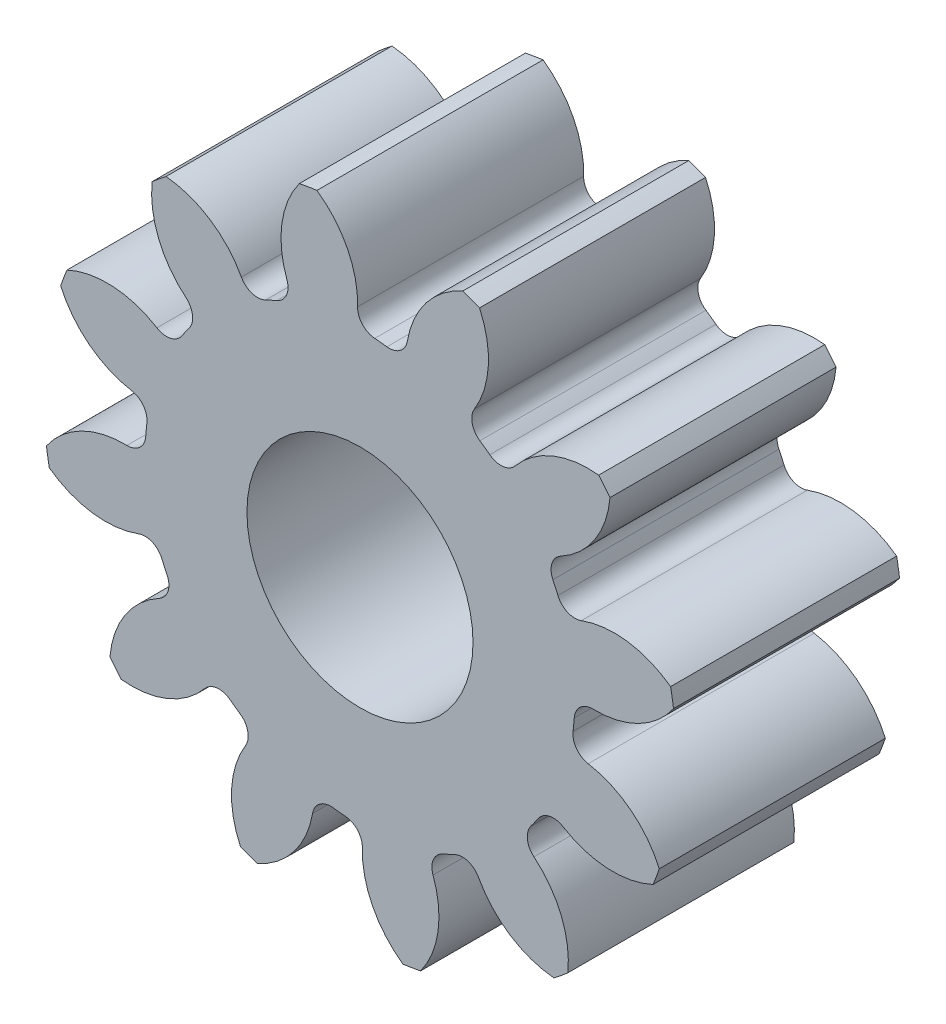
ISO-10303-21;
HEADER;
FILE_DESCRIPTION(('STEP AP214'),'2;1');
FILE_NAME('part.step','',(''),(''),'','','');
FILE_SCHEMA(('AUTOMOTIVE_DESIGN { 1 0 10303 214 1 1 1 1 }'));
ENDSEC;
DATA;
#1=APPLICATION_CONTEXT('core data for automotive mechanical design processes');
#2=APPLICATION_PROTOCOL_DEFINITION('international standard','automotive_design',2000,#1);
#3=PRODUCT_CONTEXT('',#1,'mechanical');
#4=PRODUCT('Part','Part','',(#3));
#5=PRODUCT_RELATED_PRODUCT_CATEGORY('part','',(#4));
#6=PRODUCT_DEFINITION_FORMATION('','',#4);
#7=PRODUCT_DEFINITION_CONTEXT('part definition',#1,'design');
#8=PRODUCT_DEFINITION('design','',#6,#7);
#9=PRODUCT_DEFINITION_SHAPE('','',#8);
#10=(LENGTH_UNIT() NAMED_UNIT(*) SI_UNIT(.MILLI.,.METRE.));
#11=(NAMED_UNIT(*) PLANE_ANGLE_UNIT() SI_UNIT($,.RADIAN.));
#12=(NAMED_UNIT(*) SI_UNIT($,.STERADIAN.) SOLID_ANGLE_UNIT());
#13=UNCERTAINTY_MEASURE_WITH_UNIT(LENGTH_MEASURE(1.E-05),#10,'distance_accuracy_value','');
#14=(GEOMETRIC_REPRESENTATION_CONTEXT(3) GLOBAL_UNCERTAINTY_ASSIGNED_CONTEXT((#13)) GLOBAL_UNIT_ASSIGNED_CONTEXT((#10,
#11,#12)) REPRESENTATION_CONTEXT('',''));
#15=CARTESIAN_POINT('',(0.,0.,0.));
#16=DIRECTION('',(0.,0.,1.));
#17=DIRECTION('',(1.,0.,0.));
#18=AXIS2_PLACEMENT_3D('',#15,#16,#17);
#19=CARTESIAN_POINT('',(0.,0.,101.6));
#20=DIRECTION('',(0.,0.,-1.));
#21=DIRECTION('',(-1.,0.,0.));
#22=AXIS2_PLACEMENT_3D('',#19,#20,#21);
#23=CYLINDRICAL_SURFACE('',#22,142.24);
#24=DIRECTION('',(0.,0.,-1.));
#25=VECTOR('',#24,1.);
#26=CARTESIAN_POINT('',(139.606351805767,27.2448919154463,50.8));
#27=LINE('',#26,#25);
#28=CARTESIAN_POINT('',(139.606351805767,27.2448919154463,101.6));
#29=VERTEX_POINT('',#28);
#30=CARTESIAN_POINT('',(139.606351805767,27.2448919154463,0.));
#31=VERTEX_POINT('',#30);
#32=EDGE_CURVE('E528',#29,#31,#27,.T.);
#33=ORIENTED_EDGE('',*,*,#32,.F.);
#34=CARTESIAN_POINT('',(0.,0.,101.6));
#35=DIRECTION('',(0.,0.,1.));
#36=DIRECTION('',(1.,0.,0.));
#37=AXIS2_PLACEMENT_3D('',#34,#35,#36);
#38=CIRCLE('',#37,142.24);
#39=CARTESIAN_POINT('',(140.921359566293,19.3232507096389,101.6));
#40=VERTEX_POINT('',#39);
#41=EDGE_CURVE('E945',#40,#29,#38,.T.);
#42=ORIENTED_EDGE('',*,*,#41,.F.);
#43=DIRECTION('',(0.,0.,-1.));
#44=VECTOR('',#43,1.);
#45=CARTESIAN_POINT('',(140.921359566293,19.3232507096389,50.8));
#46=LINE('',#45,#44);
#47=CARTESIAN_POINT('',(140.921359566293,19.3232507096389,0.));
#48=VERTEX_POINT('',#47);
#49=EDGE_CURVE('E939',#48,#40,#46,.F.);
#50=ORIENTED_EDGE('',*,*,#49,.F.);
#51=CARTESIAN_POINT('',(0.,0.,0.));
#52=DIRECTION('',(0.,0.,1.));
#53=DIRECTION('',(1.,0.,0.));
#54=AXIS2_PLACEMENT_3D('',#51,#52,#53);
#55=CIRCLE('',#54,142.24);
#56=EDGE_CURVE('E950',#48,#31,#55,.T.);
#57=ORIENTED_EDGE('',*,*,#56,.T.);
#58=EDGE_LOOP('',(#33,#42,#50,#57));
#59=FACE_BOUND('',#58,.T.);
#60=ADVANCED_FACE('F33',(#59),#23,.T.);
#61=DIRECTION('',(0.,0.,-1.));
#62=VECTOR('',#61,1.);
#63=CARTESIAN_POINT('',(112.379851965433,87.195105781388,50.8));
#64=LINE('',#63,#62);
#65=CARTESIAN_POINT('',(112.379851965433,87.195105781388,0.));
#66=VERTEX_POINT('',#65);
#67=CARTESIAN_POINT('',(112.379851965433,87.195105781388,101.6));
#68=VERTEX_POINT('',#67);
#69=EDGE_CURVE('E499',#66,#68,#64,.F.);
#70=ORIENTED_EDGE('',*,*,#69,.F.);
#71=CARTESIAN_POINT('',(107.280201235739,93.3979444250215,0.));
#72=VERTEX_POINT('',#71);
#73=EDGE_CURVE('E953',#66,#72,#55,.T.);
#74=ORIENTED_EDGE('',*,*,#73,.T.);
#75=DIRECTION('',(0.,0.,-1.));
#76=VECTOR('',#75,1.);
#77=CARTESIAN_POINT('',(107.280201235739,93.3979444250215,50.8));
#78=LINE('',#77,#76);
#79=CARTESIAN_POINT('',(107.280201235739,93.3979444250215,101.6));
#80=VERTEX_POINT('',#79);
#81=EDGE_CURVE('E561',#80,#72,#78,.T.);
#82=ORIENTED_EDGE('',*,*,#81,.F.);
#83=EDGE_CURVE('E948',#68,#80,#38,.T.);
#84=ORIENTED_EDGE('',*,*,#83,.F.);
#85=EDGE_LOOP('',(#70,#74,#82,#84));
#86=FACE_BOUND('',#85,.T.);
#87=ADVANCED_FACE('F1091',(#86),#23,.T.);
#88=CARTESIAN_POINT('',(0.,0.,101.6));
#89=DIRECTION('',(0.,0.,1.));
#90=DIRECTION('',(1.,0.,0.));
#91=AXIS2_PLACEMENT_3D('',#88,#89,#90);
#92=PLANE('',#91);
#93=CARTESIAN_POINT('',(0.,0.,101.599999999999));
#94=DIRECTION('',(0.,0.,1.));
#95=DIRECTION('',(1.,0.,0.));
#96=AXIS2_PLACEMENT_3D('',#93,#94,#95);
#97=CIRCLE('',#96,50.8);
#98=CARTESIAN_POINT('',(50.8,0.,101.599999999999));
#99=VERTEX_POINT('',#98);
#100=EDGE_CURVE('E516',#99,#99,#97,.T.);
#101=ORIENTED_EDGE('',*,*,#100,.F.);
#102=EDGE_LOOP('',(#101));
#103=FACE_BOUND('',#102,.T.);
#104=ORIENTED_EDGE('',*,*,#41,.T.);
#105=CARTESIAN_POINT('',(114.334997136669,-7.2924778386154,101.6));
#106=DIRECTION('',(0.,0.,-1.));
#107=DIRECTION('',(0.866025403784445,0.499999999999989,0.));
#108=AXIS2_PLACEMENT_3D('',#105,#106,#107);
#109=CIRCLE('',#108,42.7956922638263);
#110=CARTESIAN_POINT('',(99.4778140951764,32.8414901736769,101.6));
#111=VERTEX_POINT('',#110);
#112=EDGE_CURVE('E508',#111,#29,#109,.T.);
#113=ORIENTED_EDGE('',*,*,#112,.F.);
#114=CARTESIAN_POINT('',(96.6066730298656,40.597353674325,101.6));
#115=DIRECTION('',(0.,0.,1.));
#116=DIRECTION('',(-0.866025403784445,-0.499999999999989,0.));
#117=AXIS2_PLACEMENT_3D('',#114,#115,#116);
#118=CIRCLE('',#117,8.27024000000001);
#119=CARTESIAN_POINT('',(88.9822953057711,37.3933352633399,101.6));
#120=VERTEX_POINT('',#119);
#121=EDGE_CURVE('E506',#120,#111,#118,.T.);
#122=ORIENTED_EDGE('',*,*,#121,.F.);
#123=CARTESIAN_POINT('',(0.,0.,101.6));
#124=DIRECTION('',(0.,0.,-1.));
#125=DIRECTION('',(0.866025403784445,0.499999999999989,0.));
#126=AXIS2_PLACEMENT_3D('',#123,#124,#125);
#127=CIRCLE('',#126,96.52);
#128=CARTESIAN_POINT('',(86.7096513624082,42.3974853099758,101.6));
#129=VERTEX_POINT('',#128);
#130=EDGE_CURVE('E491',#129,#120,#127,.T.);
#131=ORIENTED_EDGE('',*,*,#130,.F.);
#132=CARTESIAN_POINT('',(94.1392993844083,46.0302803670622,101.6));
#133=DIRECTION('',(0.,0.,1.));
#134=DIRECTION('',(-0.866025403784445,-0.499999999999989,0.));
#135=AXIS2_PLACEMENT_3D('',#132,#133,#134);
#136=CIRCLE('',#135,8.27024000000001);
#137=CARTESIAN_POINT('',(90.1884542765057,53.2957942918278,101.6));
#138=VERTEX_POINT('',#137);
#139=EDGE_CURVE('E483',#138,#129,#136,.T.);
#140=ORIENTED_EDGE('',*,*,#139,.F.);
#141=CARTESIAN_POINT('',(69.7441683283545,90.8923692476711,101.6));
#142=DIRECTION('',(0.,0.,-1.));
#143=DIRECTION('',(-0.866025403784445,-0.499999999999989,0.));
#144=AXIS2_PLACEMENT_3D('',#141,#142,#143);
#145=CIRCLE('',#144,42.7956922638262);
#146=EDGE_CURVE('E513',#68,#138,#145,.T.);
#147=ORIENTED_EDGE('',*,*,#146,.F.);
#148=ORIENTED_EDGE('',*,*,#83,.T.);
#149=CARTESIAN_POINT('',(102.663250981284,50.8520275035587,101.6));
#150=DIRECTION('',(0.,0.,-1.));
#151=DIRECTION('',(0.50000000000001,0.866025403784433,0.));
#152=AXIS2_PLACEMENT_3D('',#149,#150,#151);
#153=CIRCLE('',#152,42.7956922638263);
#154=CARTESIAN_POINT('',(69.72956903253,78.1804718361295,101.6));
#155=VERTEX_POINT('',#154);
#156=EDGE_CURVE('E537',#155,#80,#153,.T.);
#157=ORIENTED_EDGE('',*,*,#156,.F.);
#158=CARTESIAN_POINT('',(63.365156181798,83.4616761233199,101.6));
#159=DIRECTION('',(0.,0.,1.));
#160=DIRECTION('',(-0.50000000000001,-0.866025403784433,0.));
#161=AXIS2_PLACEMENT_3D('',#158,#159,#160);
#162=CIRCLE('',#161,8.27024000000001);
#163=CARTESIAN_POINT('',(58.3642605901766,76.8747259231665,101.6));
#164=VERTEX_POINT('',#163);
#165=EDGE_CURVE('E535',#164,#155,#162,.T.);
#166=ORIENTED_EDGE('',*,*,#165,.F.);
#167=CARTESIAN_POINT('',(0.,0.,101.6));
#168=DIRECTION('',(0.,0.,-1.));
#169=DIRECTION('',(0.50000000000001,0.866025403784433,0.));
#170=AXIS2_PLACEMENT_3D('',#167,#168,#169);
#171=CIRCLE('',#170,96.52);
#172=CARTESIAN_POINT('',(53.8940181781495,80.0721250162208,101.6));
#173=VERTEX_POINT('',#172);
#174=EDGE_CURVE('E532',#173,#164,#171,.T.);
#175=ORIENTED_EDGE('',*,*,#174,.F.);
#176=CARTESIAN_POINT('',(58.5118845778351,86.9330418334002,101.6));
#177=DIRECTION('',(0.,0.,1.));
#178=DIRECTION('',(-0.50000000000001,-0.866025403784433,0.));
#179=AXIS2_PLACEMENT_3D('',#176,#177,#178);
#180=CIRCLE('',#179,8.27024000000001);
#181=CARTESIAN_POINT('',(51.4575953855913,91.2497389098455,101.6));
#182=VERTEX_POINT('',#181);
#183=EDGE_CURVE('E530',#182,#173,#180,.T.);
#184=ORIENTED_EDGE('',*,*,#183,.F.);
#185=CARTESIAN_POINT('',(14.9540369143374,113.587184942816,101.6));
#186=DIRECTION('',(0.,0.,-1.));
#187=DIRECTION('',(-0.50000000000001,-0.866025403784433,0.));
#188=AXIS2_PLACEMENT_3D('',#185,#186,#187);
#189=CIRCLE('',#188,42.7956922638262);
#190=CARTESIAN_POINT('',(53.726253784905,131.70310267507,101.6));
#191=VERTEX_POINT('',#190);
#192=EDGE_CURVE('E540',#191,#182,#189,.T.);
#193=ORIENTED_EDGE('',*,*,#192,.F.);
#194=CARTESIAN_POINT('',(46.2084073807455,134.525093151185,101.6));
#195=VERTEX_POINT('',#194);
#196=EDGE_CURVE('E985',#191,#195,#38,.T.);
#197=ORIENTED_EDGE('',*,*,#196,.T.);
#198=CARTESIAN_POINT('',(63.4829696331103,95.370773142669,101.6));
#199=DIRECTION('',(0.,0.,-1.));
#200=DIRECTION('',(0.,1.,0.));
#201=AXIS2_PLACEMENT_3D('',#198,#199,#200);
#202=CIRCLE('',#201,42.7956922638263);
#203=CARTESIAN_POINT('',(21.2973422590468,102.571059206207,101.6));
#204=VERTEX_POINT('',#203);
#205=EDGE_CURVE('E572',#204,#195,#202,.T.);
#206=ORIENTED_EDGE('',*,*,#205,.F.);
#207=CARTESIAN_POINT('',(13.1449969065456,103.962509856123,101.6));
#208=DIRECTION('',(0.,0.,1.));
#209=DIRECTION('',(0.,-1.,0.));
#210=AXIS2_PLACEMENT_3D('',#207,#208,#209);
#211=CIRCLE('',#210,8.27024000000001);
#212=CARTESIAN_POINT('',(12.1075693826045,95.7575958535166,101.6));
#213=VERTEX_POINT('',#212);
#214=EDGE_CURVE('E570',#213,#204,#211,.T.);
#215=ORIENTED_EDGE('',*,*,#214,.F.);
#216=CARTESIAN_POINT('',(0.,0.,101.6));
#217=DIRECTION('',(0.,0.,-1.));
#218=DIRECTION('',(0.,1.,0.));
#219=AXIS2_PLACEMENT_3D('',#216,#217,#218);
#220=CIRCLE('',#219,96.52);
#221=CARTESIAN_POINT('',(6.63752634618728,96.2915034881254,101.6));
#222=VERTEX_POINT('',#221);
#223=EDGE_CURVE('E567',#222,#213,#220,.T.);
#224=ORIENTED_EDGE('',*,*,#223,.F.);
#225=CARTESIAN_POINT('',(7.20625755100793,104.542164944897,101.6));
#226=DIRECTION('',(0.,0.,1.));
#227=DIRECTION('',(0.,-1.,0.));
#228=AXIS2_PLACEMENT_3D('',#225,#226,#227);
#229=CIRCLE('',#228,8.27024000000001);
#230=CARTESIAN_POINT('',(-1.06128463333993,104.753389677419,101.6));
#231=VERTEX_POINT('',#230);
#232=EDGE_CURVE('E565',#231,#222,#229,.T.);
#233=ORIENTED_EDGE('',*,*,#232,.F.);
#234=CARTESIAN_POINT('',(-43.8430166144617,105.846406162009,101.6));
#235=DIRECTION('',(0.,0.,-1.));
#236=DIRECTION('',(0.,-1.,0.));
#237=AXIS2_PLACEMENT_3D('',#234,#235,#236);
#238=CIRCLE('',#237,42.7956922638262);
#239=CARTESIAN_POINT('',(-19.3232507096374,140.921359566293,101.6));
#240=VERTEX_POINT('',#239);
#241=EDGE_CURVE('E575',#240,#231,#238,.T.);
#242=ORIENTED_EDGE('',*,*,#241,.F.);
#243=CARTESIAN_POINT('',(-27.2448919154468,139.606351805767,101.6));
#244=VERTEX_POINT('',#243);
#245=EDGE_CURVE('E1073',#240,#244,#38,.T.);
#246=ORIENTED_EDGE('',*,*,#245,.T.);
#247=CARTESIAN_POINT('',(7.292477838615,114.334997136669,101.6));
#248=DIRECTION('',(0.,0.,-1.));
#249=DIRECTION('',(-0.499999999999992,0.866025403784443,0.));
#250=AXIS2_PLACEMENT_3D('',#247,#248,#249);
#251=CIRCLE('',#250,42.7956922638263);
#252=CARTESIAN_POINT('',(-32.8414901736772,99.4778140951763,101.6));
#253=VERTEX_POINT('',#252);
#254=EDGE_CURVE('E610',#253,#244,#251,.T.);
#255=ORIENTED_EDGE('',*,*,#254,.F.);
#256=CARTESIAN_POINT('',(-40.5973536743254,96.6066730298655,101.6));
#257=DIRECTION('',(0.,0.,1.));
#258=DIRECTION('',(0.499999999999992,-0.866025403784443,0.));
#259=AXIS2_PLACEMENT_3D('',#256,#257,#258);
#260=CIRCLE('',#259,8.27024000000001);
#261=CARTESIAN_POINT('',(-37.3933352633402,88.982295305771,101.6));
#262=VERTEX_POINT('',#261);
#263=EDGE_CURVE('E608',#262,#253,#260,.T.);
#264=ORIENTED_EDGE('',*,*,#263,.F.);
#265=CARTESIAN_POINT('',(0.,0.,101.6));
#266=DIRECTION('',(0.,0.,-1.));
#267=DIRECTION('',(-0.499999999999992,0.866025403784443,0.));
#268=AXIS2_PLACEMENT_3D('',#265,#266,#267);
#269=CIRCLE('',#268,96.52);
#270=CARTESIAN_POINT('',(-42.3974853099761,86.7096513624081,101.6));
#271=VERTEX_POINT('',#270);
#272=EDGE_CURVE('E605',#271,#262,#269,.T.);
#273=ORIENTED_EDGE('',*,*,#272,.F.);
#274=CARTESIAN_POINT('',(-46.0302803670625,94.1392993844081,101.6));
#275=DIRECTION('',(0.,0.,1.));
#276=DIRECTION('',(0.499999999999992,-0.866025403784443,0.));
#277=AXIS2_PLACEMENT_3D('',#274,#275,#276);
#278=CIRCLE('',#277,8.27024000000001);
#279=CARTESIAN_POINT('',(-53.2957942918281,90.1884542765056,101.6));
#280=VERTEX_POINT('',#279);
#281=EDGE_CURVE('E603',#280,#271,#278,.T.);
#282=ORIENTED_EDGE('',*,*,#281,.F.);
#283=CARTESIAN_POINT('',(-90.8923692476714,69.7441683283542,101.6));
#284=DIRECTION('',(0.,0.,-1.));
#285=DIRECTION('',(0.499999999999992,-0.866025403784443,0.));
#286=AXIS2_PLACEMENT_3D('',#283,#284,#285);
#287=CIRCLE('',#286,42.7956922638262);
#288=CARTESIAN_POINT('',(-87.1951057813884,112.379851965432,101.6));
#289=VERTEX_POINT('',#288);
#290=EDGE_CURVE('E613',#289,#280,#287,.T.);
#291=ORIENTED_EDGE('',*,*,#290,.F.);
#292=CARTESIAN_POINT('',(-93.3979444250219,107.280201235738,101.6));
#293=VERTEX_POINT('',#292);
#294=EDGE_CURVE('E1069',#289,#293,#38,.T.);
#295=ORIENTED_EDGE('',*,*,#294,.T.);
#296=CARTESIAN_POINT('',(-50.8520275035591,102.663250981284,101.6));
#297=DIRECTION('',(0.,0.,-1.));
#298=DIRECTION('',(-0.866025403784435,0.500000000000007,0.));
#299=AXIS2_PLACEMENT_3D('',#296,#297,#298);
#300=CIRCLE('',#299,42.7956922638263);
#301=CARTESIAN_POINT('',(-78.1804718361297,69.7295690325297,101.6));
#302=VERTEX_POINT('',#301);
#303=EDGE_CURVE('E648',#302,#293,#300,.T.);
#304=ORIENTED_EDGE('',*,*,#303,.F.);
#305=CARTESIAN_POINT('',(-83.4616761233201,63.3651561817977,101.6));
#306=DIRECTION('',(0.,0.,1.));
#307=DIRECTION('',(0.866025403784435,-0.500000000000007,0.));
#308=AXIS2_PLACEMENT_3D('',#305,#306,#307);
#309=CIRCLE('',#308,8.27024000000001);
#310=CARTESIAN_POINT('',(-76.8747259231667,58.3642605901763,101.6));
#311=VERTEX_POINT('',#310);
#312=EDGE_CURVE('E646',#311,#302,#309,.T.);
#313=ORIENTED_EDGE('',*,*,#312,.F.);
#314=CARTESIAN_POINT('',(0.,0.,101.6));
#315=DIRECTION('',(0.,0.,-1.));
#316=DIRECTION('',(-0.866025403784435,0.500000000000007,0.));
#317=AXIS2_PLACEMENT_3D('',#314,#315,#316);
#318=CIRCLE('',#317,96.52);
#319=CARTESIAN_POINT('',(-80.072125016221,53.8940181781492,101.6));
#320=VERTEX_POINT('',#319);
#321=EDGE_CURVE('E643',#320,#311,#318,.T.);
#322=ORIENTED_EDGE('',*,*,#321,.F.);
#323=CARTESIAN_POINT('',(-86.9330418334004,58.5118845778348,101.6));
#324=DIRECTION('',(0.,0.,1.));
#325=DIRECTION('',(0.866025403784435,-0.500000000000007,0.));
#326=AXIS2_PLACEMENT_3D('',#323,#324,#325);
#327=CIRCLE('',#326,8.27024000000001);
#328=CARTESIAN_POINT('',(-91.2497389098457,51.4575953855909,101.6));
#329=VERTEX_POINT('',#328);
#330=EDGE_CURVE('E641',#329,#320,#327,.T.);
#331=ORIENTED_EDGE('',*,*,#330,.F.);
#332=CARTESIAN_POINT('',(-113.587184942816,14.954036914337,101.6));
#333=DIRECTION('',(0.,0.,-1.));
#334=DIRECTION('',(0.866025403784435,-0.500000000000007,0.));
#335=AXIS2_PLACEMENT_3D('',#332,#333,#334);
#336=CIRCLE('',#335,42.7956922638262);
#337=CARTESIAN_POINT('',(-131.70310267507,53.7262537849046,101.6));
#338=VERTEX_POINT('',#337);
#339=EDGE_CURVE('E651',#338,#329,#336,.T.);
#340=ORIENTED_EDGE('',*,*,#339,.F.);
#341=CARTESIAN_POINT('',(-134.525093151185,46.208407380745,101.6));
#342=VERTEX_POINT('',#341);
#343=EDGE_CURVE('E1065',#338,#342,#38,.T.);
#344=ORIENTED_EDGE('',*,*,#343,.T.);
#345=CARTESIAN_POINT('',(-95.3707731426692,63.48296963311,101.6));
#346=DIRECTION('',(0.,0.,-1.));
#347=DIRECTION('',(-1.,0.,0.));
#348=AXIS2_PLACEMENT_3D('',#345,#346,#347);
#349=CIRCLE('',#348,42.7956922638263);
#350=CARTESIAN_POINT('',(-102.571059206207,21.2973422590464,101.6));
#351=VERTEX_POINT('',#350);
#352=EDGE_CURVE('E686',#351,#342,#349,.T.);
#353=ORIENTED_EDGE('',*,*,#352,.F.);
#354=CARTESIAN_POINT('',(-103.962509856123,13.1449969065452,101.6));
#355=DIRECTION('',(0.,0.,1.));
#356=DIRECTION('',(1.,0.,0.));
#357=AXIS2_PLACEMENT_3D('',#354,#355,#356);
#358=CIRCLE('',#357,8.27024000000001);
#359=CARTESIAN_POINT('',(-95.7575958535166,12.1075693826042,101.6));
#360=VERTEX_POINT('',#359);
#361=EDGE_CURVE('E684',#360,#351,#358,.T.);
#362=ORIENTED_EDGE('',*,*,#361,.F.);
#363=CARTESIAN_POINT('',(0.,0.,101.6));
#364=DIRECTION('',(0.,0.,-1.));
#365=DIRECTION('',(-1.,0.,0.));
#366=AXIS2_PLACEMENT_3D('',#363,#364,#365);
#367=CIRCLE('',#366,96.52);
#368=CARTESIAN_POINT('',(-96.2915034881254,6.63752634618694,101.6));
#369=VERTEX_POINT('',#368);
#370=EDGE_CURVE('E681',#369,#360,#367,.T.);
#371=ORIENTED_EDGE('',*,*,#370,.F.);
#372=CARTESIAN_POINT('',(-104.542164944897,7.20625755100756,101.6));
#373=DIRECTION('',(0.,0.,1.));
#374=DIRECTION('',(1.,0.,0.));
#375=AXIS2_PLACEMENT_3D('',#372,#373,#374);
#376=CIRCLE('',#375,8.27024000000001);
#377=CARTESIAN_POINT('',(-104.753389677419,-1.0612846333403,101.6));
#378=VERTEX_POINT('',#377);
#379=EDGE_CURVE('E679',#378,#369,#376,.T.);
#380=ORIENTED_EDGE('',*,*,#379,.F.);
#381=CARTESIAN_POINT('',(-105.846406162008,-43.843016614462,101.6));
#382=DIRECTION('',(0.,0.,-1.));
#383=DIRECTION('',(1.,0.,0.));
#384=AXIS2_PLACEMENT_3D('',#381,#382,#383);
#385=CIRCLE('',#384,42.7956922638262);
#386=CARTESIAN_POINT('',(-140.921359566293,-19.3232507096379,101.6));
#387=VERTEX_POINT('',#386);
#388=EDGE_CURVE('E689',#387,#378,#385,.T.);
#389=ORIENTED_EDGE('',*,*,#388,.F.);
#390=CARTESIAN_POINT('',(-139.606351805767,-27.2448919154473,101.6));
#391=VERTEX_POINT('',#390);
#392=EDGE_CURVE('E1061',#387,#391,#38,.T.);
#393=ORIENTED_EDGE('',*,*,#392,.T.);
#394=CARTESIAN_POINT('',(-114.334997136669,7.29247783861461,101.6));
#395=DIRECTION('',(0.,0.,-1.));
#396=DIRECTION('',(-0.866025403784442,-0.499999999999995,0.));
#397=AXIS2_PLACEMENT_3D('',#394,#395,#396);
#398=CIRCLE('',#397,42.7956922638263);
#399=CARTESIAN_POINT('',(-99.4778140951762,-32.8414901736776,101.6));
#400=VERTEX_POINT('',#399);
#401=EDGE_CURVE('E724',#400,#391,#398,.T.);
#402=ORIENTED_EDGE('',*,*,#401,.F.);
#403=CARTESIAN_POINT('',(-96.6066730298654,-40.5973536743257,101.6));
#404=DIRECTION('',(0.,0.,1.));
#405=DIRECTION('',(0.866025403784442,0.499999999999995,0.));
#406=AXIS2_PLACEMENT_3D('',#403,#404,#405);
#407=CIRCLE('',#406,8.27024000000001);
#408=CARTESIAN_POINT('',(-88.9822953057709,-37.3933352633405,101.6));
#409=VERTEX_POINT('',#408);
#410=EDGE_CURVE('E722',#409,#400,#407,.T.);
#411=ORIENTED_EDGE('',*,*,#410,.F.);
#412=CARTESIAN_POINT('',(0.,0.,101.6));
#413=DIRECTION('',(0.,0.,-1.));
#414=DIRECTION('',(-0.866025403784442,-0.499999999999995,0.));
#415=AXIS2_PLACEMENT_3D('',#412,#413,#414);
#416=CIRCLE('',#415,96.52);
#417=CARTESIAN_POINT('',(-86.7096513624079,-42.3974853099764,101.6));
#418=VERTEX_POINT('',#417);
#419=EDGE_CURVE('E719',#418,#409,#416,.T.);
#420=ORIENTED_EDGE('',*,*,#419,.F.);
#421=CARTESIAN_POINT('',(-94.1392993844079,-46.0302803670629,101.6));
#422=DIRECTION('',(0.,0.,1.));
#423=DIRECTION('',(0.866025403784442,0.499999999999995,0.));
#424=AXIS2_PLACEMENT_3D('',#421,#422,#423);
#425=CIRCLE('',#424,8.27024000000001);
#426=CARTESIAN_POINT('',(-90.1884542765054,-53.2957942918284,101.6));
#427=VERTEX_POINT('',#426);
#428=EDGE_CURVE('E717',#427,#418,#425,.T.);
#429=ORIENTED_EDGE('',*,*,#428,.F.);
#430=CARTESIAN_POINT('',(-69.7441683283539,-90.8923692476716,101.6));
#431=DIRECTION('',(0.,0.,-1.));
#432=DIRECTION('',(0.866025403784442,0.499999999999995,0.));
#433=AXIS2_PLACEMENT_3D('',#430,#431,#432);
#434=CIRCLE('',#433,42.7956922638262);
#435=CARTESIAN_POINT('',(-112.379851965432,-87.1951057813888,101.6));
#436=VERTEX_POINT('',#435);
#437=EDGE_CURVE('E727',#436,#427,#434,.T.);
#438=ORIENTED_EDGE('',*,*,#437,.F.);
#439=CARTESIAN_POINT('',(-107.280201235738,-93.3979444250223,101.6));
#440=VERTEX_POINT('',#439);
#441=EDGE_CURVE('E1057',#436,#440,#38,.T.);
#442=ORIENTED_EDGE('',*,*,#441,.T.);
#443=CARTESIAN_POINT('',(-102.663250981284,-50.8520275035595,101.6));
#444=DIRECTION('',(0.,0.,-1.));
#445=DIRECTION('',(-0.500000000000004,-0.866025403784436,0.));
#446=AXIS2_PLACEMENT_3D('',#443,#444,#445);
#447=CIRCLE('',#446,42.7956922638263);
#448=CARTESIAN_POINT('',(-69.7295690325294,-78.18047183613,101.6));
#449=VERTEX_POINT('',#448);
#450=EDGE_CURVE('E762',#449,#440,#447,.T.);
#451=ORIENTED_EDGE('',*,*,#450,.F.);
#452=CARTESIAN_POINT('',(-63.3651561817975,-83.4616761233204,101.6));
#453=DIRECTION('',(0.,0.,1.));
#454=DIRECTION('',(0.500000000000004,0.866025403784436,0.));
#455=AXIS2_PLACEMENT_3D('',#452,#453,#454);
#456=CIRCLE('',#455,8.27024000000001);
#457=CARTESIAN_POINT('',(-58.3642605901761,-76.8747259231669,101.6));
#458=VERTEX_POINT('',#457);
#459=EDGE_CURVE('E760',#458,#449,#456,.T.);
#460=ORIENTED_EDGE('',*,*,#459,.F.);
#461=CARTESIAN_POINT('',(0.,0.,101.6));
#462=DIRECTION('',(0.,0.,-1.));
#463=DIRECTION('',(-0.500000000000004,-0.866025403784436,0.));
#464=AXIS2_PLACEMENT_3D('',#461,#462,#463);
#465=CIRCLE('',#464,96.52);
#466=CARTESIAN_POINT('',(-53.8940181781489,-80.0721250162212,101.6));
#467=VERTEX_POINT('',#466);
#468=EDGE_CURVE('E757',#467,#458,#465,.T.);
#469=ORIENTED_EDGE('',*,*,#468,.F.);
#470=CARTESIAN_POINT('',(-58.5118845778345,-86.9330418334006,101.6));
#471=DIRECTION('',(0.,0.,1.));
#472=DIRECTION('',(0.500000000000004,0.866025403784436,0.));
#473=AXIS2_PLACEMENT_3D('',#470,#471,#472);
#474=CIRCLE('',#473,8.27024000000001);
#475=CARTESIAN_POINT('',(-51.4575953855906,-91.2497389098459,101.6));
#476=VERTEX_POINT('',#475);
#477=EDGE_CURVE('E755',#476,#467,#474,.T.);
#478=ORIENTED_EDGE('',*,*,#477,.F.);
#479=CARTESIAN_POINT('',(-14.9540369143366,-113.587184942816,101.6));
#480=DIRECTION('',(0.,0.,-1.));
#481=DIRECTION('',(0.500000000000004,0.866025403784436,0.));
#482=AXIS2_PLACEMENT_3D('',#479,#480,#481);
#483=CIRCLE('',#482,42.7956922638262);
#484=CARTESIAN_POINT('',(-53.7262537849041,-131.70310267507,101.6));
#485=VERTEX_POINT('',#484);
#486=EDGE_CURVE('E765',#485,#476,#483,.T.);
#487=ORIENTED_EDGE('',*,*,#486,.F.);
#488=CARTESIAN_POINT('',(-46.2084073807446,-134.525093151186,101.6));
#489=VERTEX_POINT('',#488);
#490=EDGE_CURVE('E1053',#485,#489,#38,.T.);
#491=ORIENTED_EDGE('',*,*,#490,.T.);
#492=CARTESIAN_POINT('',(-63.4829696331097,-95.3707731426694,101.6));
#493=DIRECTION('',(0.,0.,-1.));
#494=DIRECTION('',(0.,-1.,0.));
#495=AXIS2_PLACEMENT_3D('',#492,#493,#494);
#496=CIRCLE('',#495,42.7956922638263);
#497=CARTESIAN_POINT('',(-21.2973422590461,-102.571059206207,101.6));
#498=VERTEX_POINT('',#497);
#499=EDGE_CURVE('E800',#498,#489,#496,.T.);
#500=ORIENTED_EDGE('',*,*,#499,.F.);
#501=CARTESIAN_POINT('',(-13.1449969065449,-103.962509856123,101.6));
#502=DIRECTION('',(0.,0.,1.));
#503=DIRECTION('',(0.,1.,0.));
#504=AXIS2_PLACEMENT_3D('',#501,#502,#503);
#505=CIRCLE('',#504,8.27024000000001);
#506=CARTESIAN_POINT('',(-12.1075693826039,-95.7575958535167,101.6));
#507=VERTEX_POINT('',#506);
#508=EDGE_CURVE('E798',#507,#498,#505,.T.);
#509=ORIENTED_EDGE('',*,*,#508,.F.);
#510=CARTESIAN_POINT('',(0.,0.,101.6));
#511=DIRECTION('',(0.,0.,-1.));
#512=DIRECTION('',(0.,-1.,0.));
#513=AXIS2_PLACEMENT_3D('',#510,#511,#512);
#514=CIRCLE('',#513,96.52);
#515=CARTESIAN_POINT('',(-6.63752634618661,-96.2915034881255,101.6));
#516=VERTEX_POINT('',#515);
#517=EDGE_CURVE('E795',#516,#507,#514,.T.);
#518=ORIENTED_EDGE('',*,*,#517,.F.);
#519=CARTESIAN_POINT('',(-7.2062575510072,-104.542164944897,101.6));
#520=DIRECTION('',(0.,0.,1.));
#521=DIRECTION('',(0.,1.,0.));
#522=AXIS2_PLACEMENT_3D('',#519,#520,#521);
#523=CIRCLE('',#522,8.27024000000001);
#524=CARTESIAN_POINT('',(1.06128463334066,-104.753389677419,101.6));
#525=VERTEX_POINT('',#524);
#526=EDGE_CURVE('E793',#525,#516,#523,.T.);
#527=ORIENTED_EDGE('',*,*,#526,.F.);
#528=CARTESIAN_POINT('',(43.8430166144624,-105.846406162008,101.6));
#529=DIRECTION('',(0.,0.,-1.));
#530=DIRECTION('',(0.,1.,0.));
#531=AXIS2_PLACEMENT_3D('',#528,#529,#530);
#532=CIRCLE('',#531,42.7956922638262);
#533=CARTESIAN_POINT('',(19.3232507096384,-140.921359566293,101.6));
#534=VERTEX_POINT('',#533);
#535=EDGE_CURVE('E803',#534,#525,#532,.T.);
#536=ORIENTED_EDGE('',*,*,#535,.F.);
#537=CARTESIAN_POINT('',(27.2448919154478,-139.606351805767,101.6));
#538=VERTEX_POINT('',#537);
#539=EDGE_CURVE('E1049',#534,#538,#38,.T.);
#540=ORIENTED_EDGE('',*,*,#539,.T.);
#541=CARTESIAN_POINT('',(-7.2924778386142,-114.334997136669,101.6));
#542=DIRECTION('',(0.,0.,-1.));
#543=DIRECTION('',(0.499999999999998,-0.86602540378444,0.));
#544=AXIS2_PLACEMENT_3D('',#541,#542,#543);
#545=CIRCLE('',#544,42.7956922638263);
#546=CARTESIAN_POINT('',(32.8414901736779,-99.4778140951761,101.6));
#547=VERTEX_POINT('',#546);
#548=EDGE_CURVE('E838',#547,#538,#545,.T.);
#549=ORIENTED_EDGE('',*,*,#548,.F.);
#550=CARTESIAN_POINT('',(40.597353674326,-96.6066730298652,101.6));
#551=DIRECTION('',(0.,0.,1.));
#552=DIRECTION('',(-0.499999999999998,0.86602540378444,0.));
#553=AXIS2_PLACEMENT_3D('',#550,#551,#552);
#554=CIRCLE('',#553,8.27024000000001);
#555=CARTESIAN_POINT('',(37.3933352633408,-88.9822953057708,101.6));
#556=VERTEX_POINT('',#555);
#557=EDGE_CURVE('E836',#556,#547,#554,.T.);
#558=ORIENTED_EDGE('',*,*,#557,.F.);
#559=CARTESIAN_POINT('',(0.,0.,101.6));
#560=DIRECTION('',(0.,0.,-1.));
#561=DIRECTION('',(0.499999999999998,-0.86602540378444,0.));
#562=AXIS2_PLACEMENT_3D('',#559,#560,#561);
#563=CIRCLE('',#562,96.52);
#564=CARTESIAN_POINT('',(42.3974853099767,-86.7096513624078,101.6));
#565=VERTEX_POINT('',#564);
#566=EDGE_CURVE('E833',#565,#556,#563,.T.);
#567=ORIENTED_EDGE('',*,*,#566,.F.);
#568=CARTESIAN_POINT('',(46.0302803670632,-94.1392993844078,101.6));
#569=DIRECTION('',(0.,0.,1.));
#570=DIRECTION('',(-0.499999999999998,0.86602540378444,0.));
#571=AXIS2_PLACEMENT_3D('',#568,#569,#570);
#572=CIRCLE('',#571,8.27024000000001);
#573=CARTESIAN_POINT('',(53.2957942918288,-90.1884542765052,101.6));
#574=VERTEX_POINT('',#573);
#575=EDGE_CURVE('E831',#574,#565,#572,.T.);
#576=ORIENTED_EDGE('',*,*,#575,.F.);
#577=CARTESIAN_POINT('',(90.8923692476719,-69.7441683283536,101.6));
#578=DIRECTION('',(0.,0.,-1.));
#579=DIRECTION('',(-0.499999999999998,0.86602540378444,0.));
#580=AXIS2_PLACEMENT_3D('',#577,#578,#579);
#581=CIRCLE('',#580,42.7956922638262);
#582=CARTESIAN_POINT('',(87.1951057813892,-112.379851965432,101.6));
#583=VERTEX_POINT('',#582);
#584=EDGE_CURVE('E841',#583,#574,#581,.T.);
#585=ORIENTED_EDGE('',*,*,#584,.F.);
#586=CARTESIAN_POINT('',(93.3979444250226,-107.280201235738,101.6));
#587=VERTEX_POINT('',#586);
#588=EDGE_CURVE('E1048',#583,#587,#38,.T.);
#589=ORIENTED_EDGE('',*,*,#588,.T.);
#590=CARTESIAN_POINT('',(50.8520275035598,-102.663250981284,101.6));
#591=DIRECTION('',(0.,0.,-1.));
#592=DIRECTION('',(0.866025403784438,-0.500000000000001,0.));
#593=AXIS2_PLACEMENT_3D('',#590,#591,#592);
#594=CIRCLE('',#593,42.7956922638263);
#595=CARTESIAN_POINT('',(78.1804718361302,-69.7295690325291,101.6));
#596=VERTEX_POINT('',#595);
#597=EDGE_CURVE('E876',#596,#587,#594,.T.);
#598=ORIENTED_EDGE('',*,*,#597,.F.);
#599=CARTESIAN_POINT('',(83.4616761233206,-63.3651561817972,101.6));
#600=DIRECTION('',(0.,0.,1.));
#601=DIRECTION('',(-0.866025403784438,0.500000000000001,0.));
#602=AXIS2_PLACEMENT_3D('',#599,#600,#601);
#603=CIRCLE('',#602,8.27024000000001);
#604=CARTESIAN_POINT('',(76.8747259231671,-58.3642605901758,101.6));
#605=VERTEX_POINT('',#604);
#606=EDGE_CURVE('E874',#605,#596,#603,.T.);
#607=ORIENTED_EDGE('',*,*,#606,.F.);
#608=CARTESIAN_POINT('',(0.,0.,101.6));
#609=DIRECTION('',(0.,0.,-1.));
#610=DIRECTION('',(0.866025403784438,-0.500000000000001,0.));
#611=AXIS2_PLACEMENT_3D('',#608,#609,#610);
#612=CIRCLE('',#611,96.52);
#613=CARTESIAN_POINT('',(80.0721250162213,-53.8940181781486,101.6));
#614=VERTEX_POINT('',#613);
#615=EDGE_CURVE('E871',#614,#605,#612,.T.);
#616=ORIENTED_EDGE('',*,*,#615,.F.);
#617=CARTESIAN_POINT('',(86.9330418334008,-58.5118845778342,101.6));
#618=DIRECTION('',(0.,0.,1.));
#619=DIRECTION('',(-0.866025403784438,0.500000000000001,0.));
#620=AXIS2_PLACEMENT_3D('',#617,#618,#619);
#621=CIRCLE('',#620,8.27024000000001);
#622=CARTESIAN_POINT('',(91.249738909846,-51.4575953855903,101.6));
#623=VERTEX_POINT('',#622);
#624=EDGE_CURVE('E869',#623,#614,#621,.T.);
#625=ORIENTED_EDGE('',*,*,#624,.F.);
#626=CARTESIAN_POINT('',(113.587184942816,-14.9540369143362,101.6));
#627=DIRECTION('',(0.,0.,-1.));
#628=DIRECTION('',(-0.866025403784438,0.500000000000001,0.));
#629=AXIS2_PLACEMENT_3D('',#626,#627,#628);
#630=CIRCLE('',#629,42.7956922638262);
#631=CARTESIAN_POINT('',(131.70310267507,-53.7262537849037,101.6));
#632=VERTEX_POINT('',#631);
#633=EDGE_CURVE('E879',#632,#623,#630,.T.);
#634=ORIENTED_EDGE('',*,*,#633,.F.);
#635=CARTESIAN_POINT('',(134.525093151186,-46.2084073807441,101.6));
#636=VERTEX_POINT('',#635);
#637=EDGE_CURVE('E949',#632,#636,#38,.T.);
#638=ORIENTED_EDGE('',*,*,#637,.T.);
#639=CARTESIAN_POINT('',(95.3707731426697,-63.4829696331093,101.6));
#640=DIRECTION('',(0.,0.,-1.));
#641=DIRECTION('',(1.,0.,0.));
#642=AXIS2_PLACEMENT_3D('',#639,#640,#641);
#643=CIRCLE('',#642,42.7956922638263);
#644=CARTESIAN_POINT('',(102.571059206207,-21.2973422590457,101.6));
#645=VERTEX_POINT('',#644);
#646=EDGE_CURVE('E914',#645,#636,#643,.T.);
#647=ORIENTED_EDGE('',*,*,#646,.F.);
#648=CARTESIAN_POINT('',(103.962509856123,-13.1449969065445,101.6));
#649=DIRECTION('',(0.,0.,1.));
#650=DIRECTION('',(-1.,0.,0.));
#651=AXIS2_PLACEMENT_3D('',#648,#649,#650);
#652=CIRCLE('',#651,8.27024000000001);
#653=CARTESIAN_POINT('',(95.7575958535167,-12.1075693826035,101.6));
#654=VERTEX_POINT('',#653);
#655=EDGE_CURVE('E912',#654,#645,#652,.T.);
#656=ORIENTED_EDGE('',*,*,#655,.F.);
#657=CARTESIAN_POINT('',(0.,0.,101.6));
#658=DIRECTION('',(0.,0.,-1.));
#659=DIRECTION('',(1.,0.,0.));
#660=AXIS2_PLACEMENT_3D('',#657,#658,#659);
#661=CIRCLE('',#660,96.52);
#662=CARTESIAN_POINT('',(96.2915034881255,-6.63752634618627,101.6));
#663=VERTEX_POINT('',#662);
#664=EDGE_CURVE('E909',#663,#654,#661,.T.);
#665=ORIENTED_EDGE('',*,*,#664,.F.);
#666=CARTESIAN_POINT('',(104.542164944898,-7.20625755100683,101.6));
#667=DIRECTION('',(0.,0.,1.));
#668=DIRECTION('',(-1.,0.,0.));
#669=AXIS2_PLACEMENT_3D('',#666,#667,#668);
#670=CIRCLE('',#669,8.27024000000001);
#671=CARTESIAN_POINT('',(104.753389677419,1.06128463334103,101.6));
#672=VERTEX_POINT('',#671);
#673=EDGE_CURVE('E907',#672,#663,#670,.T.);
#674=ORIENTED_EDGE('',*,*,#673,.F.);
#675=CARTESIAN_POINT('',(105.846406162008,43.8430166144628,101.6));
#676=DIRECTION('',(0.,0.,-1.));
#677=DIRECTION('',(-1.,0.,0.));
#678=AXIS2_PLACEMENT_3D('',#675,#676,#677);
#679=CIRCLE('',#678,42.7956922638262);
#680=EDGE_CURVE('E917',#40,#672,#679,.T.);
#681=ORIENTED_EDGE('',*,*,#680,.F.);
#682=EDGE_LOOP('',(#104,#113,#122,#131,#140,#147,#148,#157,#166,#175,#184,#193,#197,#206,#215,
#224,#233,#242,#246,#255,#264,#273,#282,#291,#295,#304,#313,#322,#331,#340,#344,#353,#362,#371,
#380,#389,#393,#402,#411,#420,#429,#438,#442,#451,#460,#469,#478,#487,#491,#500,#509,#518,#527,
#536,#540,#549,#558,#567,#576,#585,#589,#598,#607,#616,#625,#634,#638,#647,#656,#665,#674,#681));
#683=FACE_BOUND('',#682,.T.);
#684=ADVANCED_FACE('F504',(#103,#683),#92,.T.);
#685=CARTESIAN_POINT('',(0.,0.,0.));
#686=DIRECTION('',(0.,0.,1.));
#687=DIRECTION('',(1.,0.,0.));
#688=AXIS2_PLACEMENT_3D('',#685,#686,#687);
#689=PLANE('',#688);
#690=CARTESIAN_POINT('',(0.,0.,0.));
#691=DIRECTION('',(0.,0.,1.));
#692=DIRECTION('',(1.,0.,0.));
#693=AXIS2_PLACEMENT_3D('',#690,#691,#692);
#694=CIRCLE('',#693,50.8);
#695=CARTESIAN_POINT('',(50.8,0.,-1.77635683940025E-12));
#696=VERTEX_POINT('',#695);
#697=EDGE_CURVE('E36',#696,#696,#694,.T.);
#698=ORIENTED_EDGE('',*,*,#697,.T.);
#699=EDGE_LOOP('',(#698));
#700=FACE_BOUND('',#699,.T.);
#701=CARTESIAN_POINT('',(114.334997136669,-7.2924778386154,0.));
#702=DIRECTION('',(0.,0.,-1.));
#703=DIRECTION('',(0.866025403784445,0.499999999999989,0.));
#704=AXIS2_PLACEMENT_3D('',#701,#702,#703);
#705=CIRCLE('',#704,42.7956922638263);
#706=CARTESIAN_POINT('',(99.4778140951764,32.8414901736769,0.));
#707=VERTEX_POINT('',#706);
#708=EDGE_CURVE('E492',#707,#31,#705,.T.);
#709=ORIENTED_EDGE('',*,*,#708,.T.);
#710=ORIENTED_EDGE('',*,*,#56,.F.);
#711=CARTESIAN_POINT('',(105.846406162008,43.8430166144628,0.));
#712=DIRECTION('',(0.,0.,1.));
#713=DIRECTION('',(1.,0.,0.));
#714=AXIS2_PLACEMENT_3D('',#711,#712,#713);
#715=CIRCLE('',#714,42.7956922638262);
#716=CARTESIAN_POINT('',(104.753389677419,1.06128463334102,0.));
#717=VERTEX_POINT('',#716);
#718=EDGE_CURVE('E947',#717,#48,#715,.T.);
#719=ORIENTED_EDGE('',*,*,#718,.F.);
#720=CARTESIAN_POINT('',(104.542164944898,-7.20625755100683,0.));
#721=DIRECTION('',(0.,0.,1.));
#722=DIRECTION('',(-1.,0.,0.));
#723=AXIS2_PLACEMENT_3D('',#720,#721,#722);
#724=CIRCLE('',#723,8.27024000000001);
#725=CARTESIAN_POINT('',(96.2915034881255,-6.63752634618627,0.));
#726=VERTEX_POINT('',#725);
#727=EDGE_CURVE('E906',#717,#726,#724,.T.);
#728=ORIENTED_EDGE('',*,*,#727,.T.);
#729=CARTESIAN_POINT('',(0.,0.,0.));
#730=DIRECTION('',(0.,0.,-1.));
#731=DIRECTION('',(1.,0.,0.));
#732=AXIS2_PLACEMENT_3D('',#729,#730,#731);
#733=CIRCLE('',#732,96.52);
#734=CARTESIAN_POINT('',(95.7575958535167,-12.1075693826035,0.));
#735=VERTEX_POINT('',#734);
#736=EDGE_CURVE('E922',#726,#735,#733,.T.);
#737=ORIENTED_EDGE('',*,*,#736,.T.);
#738=CARTESIAN_POINT('',(103.962509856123,-13.1449969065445,0.));
#739=DIRECTION('',(0.,0.,1.));
#740=DIRECTION('',(-1.,0.,0.));
#741=AXIS2_PLACEMENT_3D('',#738,#739,#740);
#742=CIRCLE('',#741,8.27024000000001);
#743=CARTESIAN_POINT('',(102.571059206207,-21.2973422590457,0.));
#744=VERTEX_POINT('',#743);
#745=EDGE_CURVE('E925',#735,#744,#742,.T.);
#746=ORIENTED_EDGE('',*,*,#745,.T.);
#747=CARTESIAN_POINT('',(95.3707731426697,-63.4829696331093,0.));
#748=DIRECTION('',(0.,0.,-1.));
#749=DIRECTION('',(1.,0.,0.));
#750=AXIS2_PLACEMENT_3D('',#747,#748,#749);
#751=CIRCLE('',#750,42.7956922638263);
#752=CARTESIAN_POINT('',(134.525093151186,-46.2084073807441,0.));
#753=VERTEX_POINT('',#752);
#754=EDGE_CURVE('E910',#744,#753,#751,.T.);
#755=ORIENTED_EDGE('',*,*,#754,.T.);
#756=CARTESIAN_POINT('',(131.70310267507,-53.7262537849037,0.));
#757=VERTEX_POINT('',#756);
#758=EDGE_CURVE('E944',#757,#753,#55,.T.);
#759=ORIENTED_EDGE('',*,*,#758,.F.);
#760=CARTESIAN_POINT('',(113.587184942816,-14.9540369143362,0.));
#761=DIRECTION('',(0.,0.,1.));
#762=DIRECTION('',(1.,0.,0.));
#763=AXIS2_PLACEMENT_3D('',#760,#761,#762);
#764=CIRCLE('',#763,42.7956922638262);
#765=CARTESIAN_POINT('',(91.249738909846,-51.4575953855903,0.));
#766=VERTEX_POINT('',#765);
#767=EDGE_CURVE('E955',#766,#757,#764,.T.);
#768=ORIENTED_EDGE('',*,*,#767,.F.);
#769=CARTESIAN_POINT('',(86.9330418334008,-58.5118845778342,0.));
#770=DIRECTION('',(0.,0.,1.));
#771=DIRECTION('',(-0.866025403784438,0.500000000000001,0.));
#772=AXIS2_PLACEMENT_3D('',#769,#770,#771);
#773=CIRCLE('',#772,8.27024000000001);
#774=CARTESIAN_POINT('',(80.0721250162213,-53.8940181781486,0.));
#775=VERTEX_POINT('',#774);
#776=EDGE_CURVE('E868',#766,#775,#773,.T.);
#777=ORIENTED_EDGE('',*,*,#776,.T.);
#778=CARTESIAN_POINT('',(0.,0.,0.));
#779=DIRECTION('',(0.,0.,-1.));
#780=DIRECTION('',(0.866025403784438,-0.500000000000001,0.));
#781=AXIS2_PLACEMENT_3D('',#778,#779,#780);
#782=CIRCLE('',#781,96.52);
#783=CARTESIAN_POINT('',(76.8747259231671,-58.3642605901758,0.));
#784=VERTEX_POINT('',#783);
#785=EDGE_CURVE('E884',#775,#784,#782,.T.);
#786=ORIENTED_EDGE('',*,*,#785,.T.);
#787=CARTESIAN_POINT('',(83.4616761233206,-63.3651561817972,0.));
#788=DIRECTION('',(0.,0.,1.));
#789=DIRECTION('',(-0.866025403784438,0.500000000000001,0.));
#790=AXIS2_PLACEMENT_3D('',#787,#788,#789);
#791=CIRCLE('',#790,8.27024000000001);
#792=CARTESIAN_POINT('',(78.1804718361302,-69.7295690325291,0.));
#793=VERTEX_POINT('',#792);
#794=EDGE_CURVE('E887',#784,#793,#791,.T.);
#795=ORIENTED_EDGE('',*,*,#794,.T.);
#796=CARTESIAN_POINT('',(50.8520275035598,-102.663250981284,0.));
#797=DIRECTION('',(0.,0.,-1.));
#798=DIRECTION('',(0.866025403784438,-0.500000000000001,0.));
#799=AXIS2_PLACEMENT_3D('',#796,#797,#798);
#800=CIRCLE('',#799,42.7956922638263);
#801=CARTESIAN_POINT('',(93.3979444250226,-107.280201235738,0.));
#802=VERTEX_POINT('',#801);
#803=EDGE_CURVE('E872',#793,#802,#800,.T.);
#804=ORIENTED_EDGE('',*,*,#803,.T.);
#805=CARTESIAN_POINT('',(87.1951057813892,-112.379851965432,0.));
#806=VERTEX_POINT('',#805);
#807=EDGE_CURVE('E1019',#806,#802,#55,.T.);
#808=ORIENTED_EDGE('',*,*,#807,.F.);
#809=CARTESIAN_POINT('',(90.8923692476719,-69.7441683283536,0.));
#810=DIRECTION('',(0.,0.,1.));
#811=DIRECTION('',(1.,0.,0.));
#812=AXIS2_PLACEMENT_3D('',#809,#810,#811);
#813=CIRCLE('',#812,42.7956922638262);
#814=CARTESIAN_POINT('',(53.2957942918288,-90.1884542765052,0.));
#815=VERTEX_POINT('',#814);
#816=EDGE_CURVE('E957',#815,#806,#813,.T.);
#817=ORIENTED_EDGE('',*,*,#816,.F.);
#818=CARTESIAN_POINT('',(46.0302803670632,-94.1392993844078,0.));
#819=DIRECTION('',(0.,0.,1.));
#820=DIRECTION('',(-0.499999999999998,0.86602540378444,0.));
#821=AXIS2_PLACEMENT_3D('',#818,#819,#820);
#822=CIRCLE('',#821,8.27024000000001);
#823=CARTESIAN_POINT('',(42.3974853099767,-86.7096513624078,0.));
#824=VERTEX_POINT('',#823);
#825=EDGE_CURVE('E830',#815,#824,#822,.T.);
#826=ORIENTED_EDGE('',*,*,#825,.T.);
#827=CARTESIAN_POINT('',(0.,0.,0.));
#828=DIRECTION('',(0.,0.,-1.));
#829=DIRECTION('',(0.499999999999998,-0.86602540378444,0.));
#830=AXIS2_PLACEMENT_3D('',#827,#828,#829);
#831=CIRCLE('',#830,96.52);
#832=CARTESIAN_POINT('',(37.3933352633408,-88.9822953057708,0.));
#833=VERTEX_POINT('',#832);
#834=EDGE_CURVE('E846',#824,#833,#831,.T.);
#835=ORIENTED_EDGE('',*,*,#834,.T.);
#836=CARTESIAN_POINT('',(40.597353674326,-96.6066730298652,0.));
#837=DIRECTION('',(0.,0.,1.));
#838=DIRECTION('',(-0.499999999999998,0.86602540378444,0.));
#839=AXIS2_PLACEMENT_3D('',#836,#837,#838);
#840=CIRCLE('',#839,8.27024000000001);
#841=CARTESIAN_POINT('',(32.8414901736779,-99.4778140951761,0.));
#842=VERTEX_POINT('',#841);
#843=EDGE_CURVE('E849',#833,#842,#840,.T.);
#844=ORIENTED_EDGE('',*,*,#843,.T.);
#845=CARTESIAN_POINT('',(-7.2924778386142,-114.334997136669,0.));
#846=DIRECTION('',(0.,0.,-1.));
#847=DIRECTION('',(0.499999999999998,-0.86602540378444,0.));
#848=AXIS2_PLACEMENT_3D('',#845,#846,#847);
#849=CIRCLE('',#848,42.7956922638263);
#850=CARTESIAN_POINT('',(27.2448919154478,-139.606351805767,0.));
#851=VERTEX_POINT('',#850);
#852=EDGE_CURVE('E834',#842,#851,#849,.T.);
#853=ORIENTED_EDGE('',*,*,#852,.T.);
#854=CARTESIAN_POINT('',(19.3232507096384,-140.921359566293,0.));
#855=VERTEX_POINT('',#854);
#856=EDGE_CURVE('E1014',#855,#851,#55,.T.);
#857=ORIENTED_EDGE('',*,*,#856,.F.);
#858=CARTESIAN_POINT('',(43.8430166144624,-105.846406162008,0.));
#859=DIRECTION('',(0.,0.,1.));
#860=DIRECTION('',(1.,0.,0.));
#861=AXIS2_PLACEMENT_3D('',#858,#859,#860);
#862=CIRCLE('',#861,42.7956922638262);
#863=CARTESIAN_POINT('',(1.06128463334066,-104.753389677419,0.));
#864=VERTEX_POINT('',#863);
#865=EDGE_CURVE('E959',#864,#855,#862,.T.);
#866=ORIENTED_EDGE('',*,*,#865,.F.);
#867=CARTESIAN_POINT('',(-7.2062575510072,-104.542164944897,0.));
#868=DIRECTION('',(0.,0.,1.));
#869=DIRECTION('',(0.,1.,0.));
#870=AXIS2_PLACEMENT_3D('',#867,#868,#869);
#871=CIRCLE('',#870,8.27024000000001);
#872=CARTESIAN_POINT('',(-6.63752634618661,-96.2915034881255,0.));
#873=VERTEX_POINT('',#872);
#874=EDGE_CURVE('E792',#864,#873,#871,.T.);
#875=ORIENTED_EDGE('',*,*,#874,.T.);
#876=CARTESIAN_POINT('',(0.,0.,0.));
#877=DIRECTION('',(0.,0.,-1.));
#878=DIRECTION('',(0.,-1.,0.));
#879=AXIS2_PLACEMENT_3D('',#876,#877,#878);
#880=CIRCLE('',#879,96.52);
#881=CARTESIAN_POINT('',(-12.1075693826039,-95.7575958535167,0.));
#882=VERTEX_POINT('',#881);
#883=EDGE_CURVE('E808',#873,#882,#880,.T.);
#884=ORIENTED_EDGE('',*,*,#883,.T.);
#885=CARTESIAN_POINT('',(-13.1449969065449,-103.962509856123,0.));
#886=DIRECTION('',(0.,0.,1.));
#887=DIRECTION('',(0.,1.,0.));
#888=AXIS2_PLACEMENT_3D('',#885,#886,#887);
#889=CIRCLE('',#888,8.27024000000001);
#890=CARTESIAN_POINT('',(-21.2973422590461,-102.571059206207,0.));
#891=VERTEX_POINT('',#890);
#892=EDGE_CURVE('E811',#882,#891,#889,.T.);
#893=ORIENTED_EDGE('',*,*,#892,.T.);
#894=CARTESIAN_POINT('',(-63.4829696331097,-95.3707731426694,0.));
#895=DIRECTION('',(0.,0.,-1.));
#896=DIRECTION('',(0.,-1.,0.));
#897=AXIS2_PLACEMENT_3D('',#894,#895,#896);
#898=CIRCLE('',#897,42.7956922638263);
#899=CARTESIAN_POINT('',(-46.2084073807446,-134.525093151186,0.));
#900=VERTEX_POINT('',#899);
#901=EDGE_CURVE('E796',#891,#900,#898,.T.);
#902=ORIENTED_EDGE('',*,*,#901,.T.);
#903=CARTESIAN_POINT('',(-53.7262537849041,-131.70310267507,0.));
#904=VERTEX_POINT('',#903);
#905=EDGE_CURVE('E1009',#904,#900,#55,.T.);
#906=ORIENTED_EDGE('',*,*,#905,.F.);
#907=CARTESIAN_POINT('',(-14.9540369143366,-113.587184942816,0.));
#908=DIRECTION('',(0.,0.,1.));
#909=DIRECTION('',(1.,0.,0.));
#910=AXIS2_PLACEMENT_3D('',#907,#908,#909);
#911=CIRCLE('',#910,42.7956922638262);
#912=CARTESIAN_POINT('',(-51.4575953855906,-91.2497389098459,0.));
#913=VERTEX_POINT('',#912);
#914=EDGE_CURVE('E961',#913,#904,#911,.T.);
#915=ORIENTED_EDGE('',*,*,#914,.F.);
#916=CARTESIAN_POINT('',(-58.5118845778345,-86.9330418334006,0.));
#917=DIRECTION('',(0.,0.,1.));
#918=DIRECTION('',(0.500000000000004,0.866025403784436,0.));
#919=AXIS2_PLACEMENT_3D('',#916,#917,#918);
#920=CIRCLE('',#919,8.27024000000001);
#921=CARTESIAN_POINT('',(-53.8940181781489,-80.0721250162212,0.));
#922=VERTEX_POINT('',#921);
#923=EDGE_CURVE('E754',#913,#922,#920,.T.);
#924=ORIENTED_EDGE('',*,*,#923,.T.);
#925=CARTESIAN_POINT('',(0.,0.,0.));
#926=DIRECTION('',(0.,0.,-1.));
#927=DIRECTION('',(-0.500000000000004,-0.866025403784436,0.));
#928=AXIS2_PLACEMENT_3D('',#925,#926,#927);
#929=CIRCLE('',#928,96.52);
#930=CARTESIAN_POINT('',(-58.3642605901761,-76.8747259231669,0.));
#931=VERTEX_POINT('',#930);
#932=EDGE_CURVE('E770',#922,#931,#929,.T.);
#933=ORIENTED_EDGE('',*,*,#932,.T.);
#934=CARTESIAN_POINT('',(-63.3651561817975,-83.4616761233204,0.));
#935=DIRECTION('',(0.,0.,1.));
#936=DIRECTION('',(0.500000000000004,0.866025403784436,0.));
#937=AXIS2_PLACEMENT_3D('',#934,#935,#936);
#938=CIRCLE('',#937,8.27024000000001);
#939=CARTESIAN_POINT('',(-69.7295690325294,-78.18047183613,0.));
#940=VERTEX_POINT('',#939);
#941=EDGE_CURVE('E773',#931,#940,#938,.T.);
#942=ORIENTED_EDGE('',*,*,#941,.T.);
#943=CARTESIAN_POINT('',(-102.663250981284,-50.8520275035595,0.));
#944=DIRECTION('',(0.,0.,-1.));
#945=DIRECTION('',(-0.500000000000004,-0.866025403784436,0.));
#946=AXIS2_PLACEMENT_3D('',#943,#944,#945);
#947=CIRCLE('',#946,42.7956922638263);
#948=CARTESIAN_POINT('',(-107.280201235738,-93.3979444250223,0.));
#949=VERTEX_POINT('',#948);
#950=EDGE_CURVE('E758',#940,#949,#947,.T.);
#951=ORIENTED_EDGE('',*,*,#950,.T.);
#952=CARTESIAN_POINT('',(-112.379851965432,-87.1951057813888,0.));
#953=VERTEX_POINT('',#952);
#954=EDGE_CURVE('E1004',#953,#949,#55,.T.);
#955=ORIENTED_EDGE('',*,*,#954,.F.);
#956=CARTESIAN_POINT('',(-69.7441683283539,-90.8923692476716,0.));
#957=DIRECTION('',(0.,0.,1.));
#958=DIRECTION('',(1.,0.,0.));
#959=AXIS2_PLACEMENT_3D('',#956,#957,#958);
#960=CIRCLE('',#959,42.7956922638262);
#961=CARTESIAN_POINT('',(-90.1884542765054,-53.2957942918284,0.));
#962=VERTEX_POINT('',#961);
#963=EDGE_CURVE('E963',#962,#953,#960,.T.);
#964=ORIENTED_EDGE('',*,*,#963,.F.);
#965=CARTESIAN_POINT('',(-94.1392993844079,-46.0302803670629,0.));
#966=DIRECTION('',(0.,0.,1.));
#967=DIRECTION('',(0.866025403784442,0.499999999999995,0.));
#968=AXIS2_PLACEMENT_3D('',#965,#966,#967);
#969=CIRCLE('',#968,8.27024000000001);
#970=CARTESIAN_POINT('',(-86.7096513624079,-42.3974853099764,0.));
#971=VERTEX_POINT('',#970);
#972=EDGE_CURVE('E716',#962,#971,#969,.T.);
#973=ORIENTED_EDGE('',*,*,#972,.T.);
#974=CARTESIAN_POINT('',(0.,0.,0.));
#975=DIRECTION('',(0.,0.,-1.));
#976=DIRECTION('',(-0.866025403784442,-0.499999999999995,0.));
#977=AXIS2_PLACEMENT_3D('',#974,#975,#976);
#978=CIRCLE('',#977,96.52);
#979=CARTESIAN_POINT('',(-88.9822953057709,-37.3933352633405,0.));
#980=VERTEX_POINT('',#979);
#981=EDGE_CURVE('E732',#971,#980,#978,.T.);
#982=ORIENTED_EDGE('',*,*,#981,.T.);
#983=CARTESIAN_POINT('',(-96.6066730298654,-40.5973536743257,0.));
#984=DIRECTION('',(0.,0.,1.));
#985=DIRECTION('',(0.866025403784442,0.499999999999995,0.));
#986=AXIS2_PLACEMENT_3D('',#983,#984,#985);
#987=CIRCLE('',#986,8.27024000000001);
#988=CARTESIAN_POINT('',(-99.4778140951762,-32.8414901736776,0.));
#989=VERTEX_POINT('',#988);
#990=EDGE_CURVE('E735',#980,#989,#987,.T.);
#991=ORIENTED_EDGE('',*,*,#990,.T.);
#992=CARTESIAN_POINT('',(-114.334997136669,7.29247783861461,0.));
#993=DIRECTION('',(0.,0.,-1.));
#994=DIRECTION('',(-0.866025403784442,-0.499999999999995,0.));
#995=AXIS2_PLACEMENT_3D('',#992,#993,#994);
#996=CIRCLE('',#995,42.7956922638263);
#997=CARTESIAN_POINT('',(-139.606351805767,-27.2448919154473,0.));
#998=VERTEX_POINT('',#997);
#999=EDGE_CURVE('E720',#989,#998,#996,.T.);
#1000=ORIENTED_EDGE('',*,*,#999,.T.);
#1001=CARTESIAN_POINT('',(-140.921359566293,-19.3232507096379,0.));
#1002=VERTEX_POINT('',#1001);
#1003=EDGE_CURVE('E999',#1002,#998,#55,.T.);
#1004=ORIENTED_EDGE('',*,*,#1003,.F.);
#1005=CARTESIAN_POINT('',(-105.846406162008,-43.843016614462,0.));
#1006=DIRECTION('',(0.,0.,1.));
#1007=DIRECTION('',(1.,0.,0.));
#1008=AXIS2_PLACEMENT_3D('',#1005,#1006,#1007);
#1009=CIRCLE('',#1008,42.7956922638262);
#1010=CARTESIAN_POINT('',(-104.753389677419,-1.06128463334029,0.));
#1011=VERTEX_POINT('',#1010);
#1012=EDGE_CURVE('E965',#1011,#1002,#1009,.T.);
#1013=ORIENTED_EDGE('',*,*,#1012,.F.);
#1014=CARTESIAN_POINT('',(-104.542164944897,7.20625755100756,0.));
#1015=DIRECTION('',(0.,0.,1.));
#1016=DIRECTION('',(1.,0.,0.));
#1017=AXIS2_PLACEMENT_3D('',#1014,#1015,#1016);
#1018=CIRCLE('',#1017,8.27024000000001);
#1019=CARTESIAN_POINT('',(-96.2915034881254,6.63752634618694,0.));
#1020=VERTEX_POINT('',#1019);
#1021=EDGE_CURVE('E678',#1011,#1020,#1018,.T.);
#1022=ORIENTED_EDGE('',*,*,#1021,.T.);
#1023=CARTESIAN_POINT('',(0.,0.,0.));
#1024=DIRECTION('',(0.,0.,-1.));
#1025=DIRECTION('',(-1.,0.,0.));
#1026=AXIS2_PLACEMENT_3D('',#1023,#1024,#1025);
#1027=CIRCLE('',#1026,96.52);
#1028=CARTESIAN_POINT('',(-95.7575958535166,12.1075693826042,0.));
#1029=VERTEX_POINT('',#1028);
#1030=EDGE_CURVE('E694',#1020,#1029,#1027,.T.);
#1031=ORIENTED_EDGE('',*,*,#1030,.T.);
#1032=CARTESIAN_POINT('',(-103.962509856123,13.1449969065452,0.));
#1033=DIRECTION('',(0.,0.,1.));
#1034=DIRECTION('',(1.,0.,0.));
#1035=AXIS2_PLACEMENT_3D('',#1032,#1033,#1034);
#1036=CIRCLE('',#1035,8.27024000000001);
#1037=CARTESIAN_POINT('',(-102.571059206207,21.2973422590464,0.));
#1038=VERTEX_POINT('',#1037);
#1039=EDGE_CURVE('E697',#1029,#1038,#1036,.T.);
#1040=ORIENTED_EDGE('',*,*,#1039,.T.);
#1041=CARTESIAN_POINT('',(-95.3707731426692,63.48296963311,0.));
#1042=DIRECTION('',(0.,0.,-1.));
#1043=DIRECTION('',(-1.,0.,0.));
#1044=AXIS2_PLACEMENT_3D('',#1041,#1042,#1043);
#1045=CIRCLE('',#1044,42.7956922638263);
#1046=CARTESIAN_POINT('',(-134.525093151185,46.208407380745,0.));
#1047=VERTEX_POINT('',#1046);
#1048=EDGE_CURVE('E682',#1038,#1047,#1045,.T.);
#1049=ORIENTED_EDGE('',*,*,#1048,.T.);
#1050=CARTESIAN_POINT('',(-131.70310267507,53.7262537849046,0.));
#1051=VERTEX_POINT('',#1050);
#1052=EDGE_CURVE('E994',#1051,#1047,#55,.T.);
#1053=ORIENTED_EDGE('',*,*,#1052,.F.);
#1054=CARTESIAN_POINT('',(-113.587184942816,14.954036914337,0.));
#1055=DIRECTION('',(0.,0.,1.));
#1056=DIRECTION('',(1.,0.,0.));
#1057=AXIS2_PLACEMENT_3D('',#1054,#1055,#1056);
#1058=CIRCLE('',#1057,42.7956922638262);
#1059=CARTESIAN_POINT('',(-91.2497389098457,51.4575953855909,0.));
#1060=VERTEX_POINT('',#1059);
#1061=EDGE_CURVE('E967',#1060,#1051,#1058,.T.);
#1062=ORIENTED_EDGE('',*,*,#1061,.F.);
#1063=CARTESIAN_POINT('',(-86.9330418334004,58.5118845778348,0.));
#1064=DIRECTION('',(0.,0.,1.));
#1065=DIRECTION('',(0.866025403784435,-0.500000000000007,0.));
#1066=AXIS2_PLACEMENT_3D('',#1063,#1064,#1065);
#1067=CIRCLE('',#1066,8.27024000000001);
#1068=CARTESIAN_POINT('',(-80.072125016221,53.8940181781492,0.));
#1069=VERTEX_POINT('',#1068);
#1070=EDGE_CURVE('E640',#1060,#1069,#1067,.T.);
#1071=ORIENTED_EDGE('',*,*,#1070,.T.);
#1072=CARTESIAN_POINT('',(0.,0.,0.));
#1073=DIRECTION('',(0.,0.,-1.));
#1074=DIRECTION('',(-0.866025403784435,0.500000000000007,0.));
#1075=AXIS2_PLACEMENT_3D('',#1072,#1073,#1074);
#1076=CIRCLE('',#1075,96.52);
#1077=CARTESIAN_POINT('',(-76.8747259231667,58.3642605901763,0.));
#1078=VERTEX_POINT('',#1077);
#1079=EDGE_CURVE('E656',#1069,#1078,#1076,.T.);
#1080=ORIENTED_EDGE('',*,*,#1079,.T.);
#1081=CARTESIAN_POINT('',(-83.4616761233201,63.3651561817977,0.));
#1082=DIRECTION('',(0.,0.,1.));
#1083=DIRECTION('',(0.866025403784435,-0.500000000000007,0.));
#1084=AXIS2_PLACEMENT_3D('',#1081,#1082,#1083);
#1085=CIRCLE('',#1084,8.27024000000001);
#1086=CARTESIAN_POINT('',(-78.1804718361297,69.7295690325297,0.));
#1087=VERTEX_POINT('',#1086);
#1088=EDGE_CURVE('E659',#1078,#1087,#1085,.T.);
#1089=ORIENTED_EDGE('',*,*,#1088,.T.);
#1090=CARTESIAN_POINT('',(-50.8520275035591,102.663250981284,0.));
#1091=DIRECTION('',(0.,0.,-1.));
#1092=DIRECTION('',(-0.866025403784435,0.500000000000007,0.));
#1093=AXIS2_PLACEMENT_3D('',#1090,#1091,#1092);
#1094=CIRCLE('',#1093,42.7956922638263);
#1095=CARTESIAN_POINT('',(-93.3979444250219,107.280201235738,0.));
#1096=VERTEX_POINT('',#1095);
#1097=EDGE_CURVE('E644',#1087,#1096,#1094,.T.);
#1098=ORIENTED_EDGE('',*,*,#1097,.T.);
#1099=CARTESIAN_POINT('',(-87.1951057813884,112.379851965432,0.));
#1100=VERTEX_POINT('',#1099);
#1101=EDGE_CURVE('E989',#1100,#1096,#55,.T.);
#1102=ORIENTED_EDGE('',*,*,#1101,.F.);
#1103=CARTESIAN_POINT('',(-90.8923692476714,69.7441683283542,0.));
#1104=DIRECTION('',(0.,0.,1.));
#1105=DIRECTION('',(1.,0.,0.));
#1106=AXIS2_PLACEMENT_3D('',#1103,#1104,#1105);
#1107=CIRCLE('',#1106,42.7956922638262);
#1108=CARTESIAN_POINT('',(-53.2957942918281,90.1884542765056,0.));
#1109=VERTEX_POINT('',#1108);
#1110=EDGE_CURVE('E969',#1109,#1100,#1107,.T.);
#1111=ORIENTED_EDGE('',*,*,#1110,.F.);
#1112=CARTESIAN_POINT('',(-46.0302803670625,94.1392993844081,0.));
#1113=DIRECTION('',(0.,0.,1.));
#1114=DIRECTION('',(0.499999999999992,-0.866025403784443,0.));
#1115=AXIS2_PLACEMENT_3D('',#1112,#1113,#1114);
#1116=CIRCLE('',#1115,8.27024000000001);
#1117=CARTESIAN_POINT('',(-42.3974853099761,86.7096513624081,0.));
#1118=VERTEX_POINT('',#1117);
#1119=EDGE_CURVE('E602',#1109,#1118,#1116,.T.);
#1120=ORIENTED_EDGE('',*,*,#1119,.T.);
#1121=CARTESIAN_POINT('',(0.,0.,0.));
#1122=DIRECTION('',(0.,0.,-1.));
#1123=DIRECTION('',(-0.499999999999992,0.866025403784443,0.));
#1124=AXIS2_PLACEMENT_3D('',#1121,#1122,#1123);
#1125=CIRCLE('',#1124,96.52);
#1126=CARTESIAN_POINT('',(-37.3933352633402,88.982295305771,0.));
#1127=VERTEX_POINT('',#1126);
#1128=EDGE_CURVE('E618',#1118,#1127,#1125,.T.);
#1129=ORIENTED_EDGE('',*,*,#1128,.T.);
#1130=CARTESIAN_POINT('',(-40.5973536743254,96.6066730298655,0.));
#1131=DIRECTION('',(0.,0.,1.));
#1132=DIRECTION('',(0.499999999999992,-0.866025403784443,0.));
#1133=AXIS2_PLACEMENT_3D('',#1130,#1131,#1132);
#1134=CIRCLE('',#1133,8.27024000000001);
#1135=CARTESIAN_POINT('',(-32.8414901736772,99.4778140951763,0.));
#1136=VERTEX_POINT('',#1135);
#1137=EDGE_CURVE('E621',#1127,#1136,#1134,.T.);
#1138=ORIENTED_EDGE('',*,*,#1137,.T.);
#1139=CARTESIAN_POINT('',(7.292477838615,114.334997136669,0.));
#1140=DIRECTION('',(0.,0.,-1.));
#1141=DIRECTION('',(-0.499999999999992,0.866025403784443,0.));
#1142=AXIS2_PLACEMENT_3D('',#1139,#1140,#1141);
#1143=CIRCLE('',#1142,42.7956922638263);
#1144=CARTESIAN_POINT('',(-27.2448919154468,139.606351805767,0.));
#1145=VERTEX_POINT('',#1144);
#1146=EDGE_CURVE('E606',#1136,#1145,#1143,.T.);
#1147=ORIENTED_EDGE('',*,*,#1146,.T.);
#1148=CARTESIAN_POINT('',(-19.3232507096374,140.921359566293,0.));
#1149=VERTEX_POINT('',#1148);
#1150=EDGE_CURVE('E988',#1149,#1145,#55,.T.);
#1151=ORIENTED_EDGE('',*,*,#1150,.F.);
#1152=CARTESIAN_POINT('',(-43.8430166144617,105.846406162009,0.));
#1153=DIRECTION('',(0.,0.,1.));
#1154=DIRECTION('',(1.,0.,0.));
#1155=AXIS2_PLACEMENT_3D('',#1152,#1153,#1154);
#1156=CIRCLE('',#1155,42.7956922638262);
#1157=CARTESIAN_POINT('',(-1.06128463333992,104.753389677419,0.));
#1158=VERTEX_POINT('',#1157);
#1159=EDGE_CURVE('E971',#1158,#1149,#1156,.T.);
#1160=ORIENTED_EDGE('',*,*,#1159,.F.);
#1161=CARTESIAN_POINT('',(7.20625755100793,104.542164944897,0.));
#1162=DIRECTION('',(0.,0.,1.));
#1163=DIRECTION('',(0.,-1.,0.));
#1164=AXIS2_PLACEMENT_3D('',#1161,#1162,#1163);
#1165=CIRCLE('',#1164,8.27024000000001);
#1166=CARTESIAN_POINT('',(6.63752634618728,96.2915034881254,0.));
#1167=VERTEX_POINT('',#1166);
#1168=EDGE_CURVE('E564',#1158,#1167,#1165,.T.);
#1169=ORIENTED_EDGE('',*,*,#1168,.T.);
#1170=CARTESIAN_POINT('',(0.,0.,0.));
#1171=DIRECTION('',(0.,0.,-1.));
#1172=DIRECTION('',(0.,1.,0.));
#1173=AXIS2_PLACEMENT_3D('',#1170,#1171,#1172);
#1174=CIRCLE('',#1173,96.52);
#1175=CARTESIAN_POINT('',(12.1075693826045,95.7575958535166,0.));
#1176=VERTEX_POINT('',#1175);
#1177=EDGE_CURVE('E580',#1167,#1176,#1174,.T.);
#1178=ORIENTED_EDGE('',*,*,#1177,.T.);
#1179=CARTESIAN_POINT('',(13.1449969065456,103.962509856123,0.));
#1180=DIRECTION('',(0.,0.,1.));
#1181=DIRECTION('',(0.,-1.,0.));
#1182=AXIS2_PLACEMENT_3D('',#1179,#1180,#1181);
#1183=CIRCLE('',#1182,8.27024000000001);
#1184=CARTESIAN_POINT('',(21.2973422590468,102.571059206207,0.));
#1185=VERTEX_POINT('',#1184);
#1186=EDGE_CURVE('E583',#1176,#1185,#1183,.T.);
#1187=ORIENTED_EDGE('',*,*,#1186,.T.);
#1188=CARTESIAN_POINT('',(63.4829696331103,95.370773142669,0.));
#1189=DIRECTION('',(0.,0.,-1.));
#1190=DIRECTION('',(0.,1.,0.));
#1191=AXIS2_PLACEMENT_3D('',#1188,#1189,#1190);
#1192=CIRCLE('',#1191,42.7956922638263);
#1193=CARTESIAN_POINT('',(46.2084073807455,134.525093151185,0.));
#1194=VERTEX_POINT('',#1193);
#1195=EDGE_CURVE('E568',#1185,#1194,#1192,.T.);
#1196=ORIENTED_EDGE('',*,*,#1195,.T.);
#1197=CARTESIAN_POINT('',(53.726253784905,131.70310267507,0.));
#1198=VERTEX_POINT('',#1197);
#1199=EDGE_CURVE('E984',#1198,#1194,#55,.T.);
#1200=ORIENTED_EDGE('',*,*,#1199,.F.);
#1201=CARTESIAN_POINT('',(14.9540369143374,113.587184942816,0.));
#1202=DIRECTION('',(0.,0.,1.));
#1203=DIRECTION('',(1.,0.,0.));
#1204=AXIS2_PLACEMENT_3D('',#1201,#1202,#1203);
#1205=CIRCLE('',#1204,42.7956922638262);
#1206=CARTESIAN_POINT('',(51.4575953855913,91.2497389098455,0.));
#1207=VERTEX_POINT('',#1206);
#1208=EDGE_CURVE('E41',#1207,#1198,#1205,.T.);
#1209=ORIENTED_EDGE('',*,*,#1208,.F.);
#1210=CARTESIAN_POINT('',(58.5118845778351,86.9330418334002,0.));
#1211=DIRECTION('',(0.,0.,1.));
#1212=DIRECTION('',(-0.50000000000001,-0.866025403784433,0.));
#1213=AXIS2_PLACEMENT_3D('',#1210,#1211,#1212);
#1214=CIRCLE('',#1213,8.27024000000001);
#1215=CARTESIAN_POINT('',(53.8940181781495,80.0721250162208,0.));
#1216=VERTEX_POINT('',#1215);
#1217=EDGE_CURVE('E56',#1207,#1216,#1214,.T.);
#1218=ORIENTED_EDGE('',*,*,#1217,.T.);
#1219=CARTESIAN_POINT('',(0.,0.,0.));
#1220=DIRECTION('',(0.,0.,-1.));
#1221=DIRECTION('',(0.50000000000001,0.866025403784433,0.));
#1222=AXIS2_PLACEMENT_3D('',#1219,#1220,#1221);
#1223=CIRCLE('',#1222,96.52);
#1224=CARTESIAN_POINT('',(58.3642605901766,76.8747259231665,0.));
#1225=VERTEX_POINT('',#1224);
#1226=EDGE_CURVE('E544',#1216,#1225,#1223,.T.);
#1227=ORIENTED_EDGE('',*,*,#1226,.T.);
#1228=CARTESIAN_POINT('',(63.365156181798,83.4616761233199,0.));
#1229=DIRECTION('',(0.,0.,1.));
#1230=DIRECTION('',(-0.50000000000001,-0.866025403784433,0.));
#1231=AXIS2_PLACEMENT_3D('',#1228,#1229,#1230);
#1232=CIRCLE('',#1231,8.27024000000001);
#1233=CARTESIAN_POINT('',(69.72956903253,78.1804718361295,0.));
#1234=VERTEX_POINT('',#1233);
#1235=EDGE_CURVE('E547',#1225,#1234,#1232,.T.);
#1236=ORIENTED_EDGE('',*,*,#1235,.T.);
#1237=CARTESIAN_POINT('',(102.663250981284,50.8520275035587,0.));
#1238=DIRECTION('',(0.,0.,-1.));
#1239=DIRECTION('',(0.50000000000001,0.866025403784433,0.));
#1240=AXIS2_PLACEMENT_3D('',#1237,#1238,#1239);
#1241=CIRCLE('',#1240,42.7956922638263);
#1242=EDGE_CURVE('E533',#1234,#72,#1241,.T.);
#1243=ORIENTED_EDGE('',*,*,#1242,.T.);
#1244=ORIENTED_EDGE('',*,*,#73,.F.);
#1245=CARTESIAN_POINT('',(69.7441683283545,90.8923692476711,0.));
#1246=DIRECTION('',(0.,0.,1.));
#1247=DIRECTION('',(1.,0.,0.));
#1248=AXIS2_PLACEMENT_3D('',#1245,#1246,#1247);
#1249=CIRCLE('',#1248,42.7956922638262);
#1250=CARTESIAN_POINT('',(90.1884542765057,53.2957942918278,0.));
#1251=VERTEX_POINT('',#1250);
#1252=EDGE_CURVE('E11',#1251,#66,#1249,.T.);
#1253=ORIENTED_EDGE('',*,*,#1252,.F.);
#1254=CARTESIAN_POINT('',(94.1392993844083,46.0302803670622,0.));
#1255=DIRECTION('',(0.,0.,1.));
#1256=DIRECTION('',(-0.866025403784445,-0.499999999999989,0.));
#1257=AXIS2_PLACEMENT_3D('',#1254,#1255,#1256);
#1258=CIRCLE('',#1257,8.27024000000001);
#1259=CARTESIAN_POINT('',(86.7096513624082,42.3974853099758,0.));
#1260=VERTEX_POINT('',#1259);
#1261=EDGE_CURVE('E48',#1251,#1260,#1258,.T.);
#1262=ORIENTED_EDGE('',*,*,#1261,.T.);
#1263=CARTESIAN_POINT('',(0.,0.,0.));
#1264=DIRECTION('',(0.,0.,-1.));
#1265=DIRECTION('',(0.866025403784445,0.499999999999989,0.));
#1266=AXIS2_PLACEMENT_3D('',#1263,#1264,#1265);
#1267=CIRCLE('',#1266,96.52);
#1268=CARTESIAN_POINT('',(88.9822953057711,37.3933352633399,0.));
#1269=VERTEX_POINT('',#1268);
#1270=EDGE_CURVE('E498',#1260,#1269,#1267,.T.);
#1271=ORIENTED_EDGE('',*,*,#1270,.T.);
#1272=CARTESIAN_POINT('',(96.6066730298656,40.597353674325,0.));
#1273=DIRECTION('',(0.,0.,1.));
#1274=DIRECTION('',(-0.866025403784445,-0.499999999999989,0.));
#1275=AXIS2_PLACEMENT_3D('',#1272,#1273,#1274);
#1276=CIRCLE('',#1275,8.27024000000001);
#1277=EDGE_CURVE('E518',#1269,#707,#1276,.T.);
#1278=ORIENTED_EDGE('',*,*,#1277,.T.);
#1279=EDGE_LOOP('',(#709,#710,#719,#728,#737,#746,#755,#759,#768,#777,#786,#795,#804,#808,#817,
#826,#835,#844,#853,#857,#866,#875,#884,#893,#902,#906,#915,#924,#933,#942,#951,#955,#964,#973,
#982,#991,#1000,#1004,#1013,#1022,#1031,#1040,#1049,#1053,#1062,#1071,#1080,#1089,#1098,#1102,
#1111,#1120,#1129,#1138,#1147,#1151,#1160,#1169,#1178,#1187,#1196,#1200,#1209,#1218,#1227,#1236,
#1243,#1244,#1253,#1262,#1271,#1278));
#1280=FACE_BOUND('',#1279,.T.);
#1281=ADVANCED_FACE('F986',(#700,#1280),#689,.F.);
#1282=DIRECTION('',(0.,0.,-1.));
#1283=VECTOR('',#1282,1.);
#1284=CARTESIAN_POINT('',(53.7262537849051,131.70310267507,50.8));
#1285=LINE('',#1284,#1283);
#1286=EDGE_CURVE('E559',#1198,#191,#1285,.F.);
#1287=ORIENTED_EDGE('',*,*,#1286,.F.);
#1288=ORIENTED_EDGE('',*,*,#1199,.T.);
#1289=DIRECTION('',(0.,0.,-1.));
#1290=VECTOR('',#1289,1.);
#1291=CARTESIAN_POINT('',(46.2084073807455,134.525093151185,50.8));
#1292=LINE('',#1291,#1290);
#1293=EDGE_CURVE('E599',#195,#1194,#1292,.T.);
#1294=ORIENTED_EDGE('',*,*,#1293,.F.);
#1295=ORIENTED_EDGE('',*,*,#196,.F.);
#1296=EDGE_LOOP('',(#1287,#1288,#1294,#1295));
#1297=FACE_BOUND('',#1296,.T.);
#1298=ADVANCED_FACE('F982',(#1297),#23,.T.);
#1299=DIRECTION('',(0.,0.,-1.));
#1300=VECTOR('',#1299,1.);
#1301=CARTESIAN_POINT('',(-19.3232507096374,140.921359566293,50.8));
#1302=LINE('',#1301,#1300);
#1303=EDGE_CURVE('E597',#1149,#240,#1302,.F.);
#1304=ORIENTED_EDGE('',*,*,#1303,.F.);
#1305=ORIENTED_EDGE('',*,*,#1150,.T.);
#1306=DIRECTION('',(0.,0.,-1.));
#1307=VECTOR('',#1306,1.);
#1308=CARTESIAN_POINT('',(-27.2448919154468,139.606351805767,50.8));
#1309=LINE('',#1308,#1307);
#1310=EDGE_CURVE('E637',#244,#1145,#1309,.T.);
#1311=ORIENTED_EDGE('',*,*,#1310,.F.);
#1312=ORIENTED_EDGE('',*,*,#245,.F.);
#1313=EDGE_LOOP('',(#1304,#1305,#1311,#1312));
#1314=FACE_BOUND('',#1313,.T.);
#1315=ADVANCED_FACE('F1189',(#1314),#23,.T.);
#1316=DIRECTION('',(0.,0.,-1.));
#1317=VECTOR('',#1316,1.);
#1318=CARTESIAN_POINT('',(-87.1951057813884,112.379851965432,50.8));
#1319=LINE('',#1318,#1317);
#1320=EDGE_CURVE('E635',#1100,#289,#1319,.F.);
#1321=ORIENTED_EDGE('',*,*,#1320,.F.);
#1322=ORIENTED_EDGE('',*,*,#1101,.T.);
#1323=DIRECTION('',(0.,0.,-1.));
#1324=VECTOR('',#1323,1.);
#1325=CARTESIAN_POINT('',(-93.3979444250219,107.280201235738,50.8));
#1326=LINE('',#1325,#1324);
#1327=EDGE_CURVE('E675',#293,#1096,#1326,.T.);
#1328=ORIENTED_EDGE('',*,*,#1327,.F.);
#1329=ORIENTED_EDGE('',*,*,#294,.F.);
#1330=EDGE_LOOP('',(#1321,#1322,#1328,#1329));
#1331=FACE_BOUND('',#1330,.T.);
#1332=ADVANCED_FACE('F1277',(#1331),#23,.T.);
#1333=DIRECTION('',(0.,0.,-1.));
#1334=VECTOR('',#1333,1.);
#1335=CARTESIAN_POINT('',(-131.70310267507,53.7262537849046,50.8));
#1336=LINE('',#1335,#1334);
#1337=EDGE_CURVE('E673',#1051,#338,#1336,.F.);
#1338=ORIENTED_EDGE('',*,*,#1337,.F.);
#1339=ORIENTED_EDGE('',*,*,#1052,.T.);
#1340=DIRECTION('',(0.,0.,-1.));
#1341=VECTOR('',#1340,1.);
#1342=CARTESIAN_POINT('',(-134.525093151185,46.208407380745,50.8));
#1343=LINE('',#1342,#1341);
#1344=EDGE_CURVE('E713',#342,#1047,#1343,.T.);
#1345=ORIENTED_EDGE('',*,*,#1344,.F.);
#1346=ORIENTED_EDGE('',*,*,#343,.F.);
#1347=EDGE_LOOP('',(#1338,#1339,#1345,#1346));
#1348=FACE_BOUND('',#1347,.T.);
#1349=ADVANCED_FACE('F1284',(#1348),#23,.T.);
#1350=DIRECTION('',(0.,0.,-1.));
#1351=VECTOR('',#1350,1.);
#1352=CARTESIAN_POINT('',(-140.921359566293,-19.3232507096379,50.8));
#1353=LINE('',#1352,#1351);
#1354=EDGE_CURVE('E711',#1002,#387,#1353,.F.);
#1355=ORIENTED_EDGE('',*,*,#1354,.F.);
#1356=ORIENTED_EDGE('',*,*,#1003,.T.);
#1357=DIRECTION('',(0.,0.,-1.));
#1358=VECTOR('',#1357,1.);
#1359=CARTESIAN_POINT('',(-139.606351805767,-27.2448919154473,50.8));
#1360=LINE('',#1359,#1358);
#1361=EDGE_CURVE('E751',#391,#998,#1360,.T.);
#1362=ORIENTED_EDGE('',*,*,#1361,.F.);
#1363=ORIENTED_EDGE('',*,*,#392,.F.);
#1364=EDGE_LOOP('',(#1355,#1356,#1362,#1363));
#1365=FACE_BOUND('',#1364,.T.);
#1366=ADVANCED_FACE('F1291',(#1365),#23,.T.);
#1367=DIRECTION('',(0.,0.,-1.));
#1368=VECTOR('',#1367,1.);
#1369=CARTESIAN_POINT('',(-112.379851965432,-87.1951057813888,50.8));
#1370=LINE('',#1369,#1368);
#1371=EDGE_CURVE('E749',#953,#436,#1370,.F.);
#1372=ORIENTED_EDGE('',*,*,#1371,.F.);
#1373=ORIENTED_EDGE('',*,*,#954,.T.);
#1374=DIRECTION('',(0.,0.,-1.));
#1375=VECTOR('',#1374,1.);
#1376=CARTESIAN_POINT('',(-107.280201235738,-93.3979444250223,50.8));
#1377=LINE('',#1376,#1375);
#1378=EDGE_CURVE('E789',#440,#949,#1377,.T.);
#1379=ORIENTED_EDGE('',*,*,#1378,.F.);
#1380=ORIENTED_EDGE('',*,*,#441,.F.);
#1381=EDGE_LOOP('',(#1372,#1373,#1379,#1380));
#1382=FACE_BOUND('',#1381,.T.);
#1383=ADVANCED_FACE('F1298',(#1382),#23,.T.);
#1384=DIRECTION('',(0.,0.,-1.));
#1385=VECTOR('',#1384,1.);
#1386=CARTESIAN_POINT('',(-53.7262537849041,-131.70310267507,50.8));
#1387=LINE('',#1386,#1385);
#1388=EDGE_CURVE('E787',#904,#485,#1387,.F.);
#1389=ORIENTED_EDGE('',*,*,#1388,.F.);
#1390=ORIENTED_EDGE('',*,*,#905,.T.);
#1391=DIRECTION('',(0.,0.,-1.));
#1392=VECTOR('',#1391,1.);
#1393=CARTESIAN_POINT('',(-46.2084073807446,-134.525093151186,50.8));
#1394=LINE('',#1393,#1392);
#1395=EDGE_CURVE('E827',#489,#900,#1394,.T.);
#1396=ORIENTED_EDGE('',*,*,#1395,.F.);
#1397=ORIENTED_EDGE('',*,*,#490,.F.);
#1398=EDGE_LOOP('',(#1389,#1390,#1396,#1397));
#1399=FACE_BOUND('',#1398,.T.);
#1400=ADVANCED_FACE('F1131',(#1399),#23,.T.);
#1401=DIRECTION('',(0.,0.,-1.));
#1402=VECTOR('',#1401,1.);
#1403=CARTESIAN_POINT('',(19.3232507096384,-140.921359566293,50.8));
#1404=LINE('',#1403,#1402);
#1405=EDGE_CURVE('E825',#855,#534,#1404,.F.);
#1406=ORIENTED_EDGE('',*,*,#1405,.F.);
#1407=ORIENTED_EDGE('',*,*,#856,.T.);
#1408=DIRECTION('',(0.,0.,-1.));
#1409=VECTOR('',#1408,1.);
#1410=CARTESIAN_POINT('',(27.2448919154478,-139.606351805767,50.8));
#1411=LINE('',#1410,#1409);
#1412=EDGE_CURVE('E865',#538,#851,#1411,.T.);
#1413=ORIENTED_EDGE('',*,*,#1412,.F.);
#1414=ORIENTED_EDGE('',*,*,#539,.F.);
#1415=EDGE_LOOP('',(#1406,#1407,#1413,#1414));
#1416=FACE_BOUND('',#1415,.T.);
#1417=ADVANCED_FACE('F1127',(#1416),#23,.T.);
#1418=DIRECTION('',(0.,0.,-1.));
#1419=VECTOR('',#1418,1.);
#1420=CARTESIAN_POINT('',(87.1951057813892,-112.379851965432,50.8));
#1421=LINE('',#1420,#1419);
#1422=EDGE_CURVE('E863',#806,#583,#1421,.F.);
#1423=ORIENTED_EDGE('',*,*,#1422,.F.);
#1424=ORIENTED_EDGE('',*,*,#807,.T.);
#1425=DIRECTION('',(0.,0.,-1.));
#1426=VECTOR('',#1425,1.);
#1427=CARTESIAN_POINT('',(93.3979444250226,-107.280201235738,50.8));
#1428=LINE('',#1427,#1426);
#1429=EDGE_CURVE('E903',#587,#802,#1428,.T.);
#1430=ORIENTED_EDGE('',*,*,#1429,.F.);
#1431=ORIENTED_EDGE('',*,*,#588,.F.);
#1432=EDGE_LOOP('',(#1423,#1424,#1430,#1431));
#1433=FACE_BOUND('',#1432,.T.);
#1434=ADVANCED_FACE('F1120',(#1433),#23,.T.);
#1435=DIRECTION('',(0.,0.,-1.));
#1436=VECTOR('',#1435,1.);
#1437=CARTESIAN_POINT('',(131.70310267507,-53.7262537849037,50.8));
#1438=LINE('',#1437,#1436);
#1439=EDGE_CURVE('E901',#757,#632,#1438,.F.);
#1440=ORIENTED_EDGE('',*,*,#1439,.F.);
#1441=ORIENTED_EDGE('',*,*,#758,.T.);
#1442=DIRECTION('',(0.,0.,-1.));
#1443=VECTOR('',#1442,1.);
#1444=CARTESIAN_POINT('',(134.525093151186,-46.2084073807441,50.8));
#1445=LINE('',#1444,#1443);
#1446=EDGE_CURVE('E941',#636,#753,#1445,.T.);
#1447=ORIENTED_EDGE('',*,*,#1446,.F.);
#1448=ORIENTED_EDGE('',*,*,#637,.F.);
#1449=EDGE_LOOP('',(#1440,#1441,#1447,#1448));
#1450=FACE_BOUND('',#1449,.T.);
#1451=ADVANCED_FACE('F1032',(#1450),#23,.T.);
#1452=CARTESIAN_POINT('',(95.3707731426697,-63.4829696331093,101.6));
#1453=DIRECTION('',(0.,0.,-1.));
#1454=DIRECTION('',(-1.,0.,0.));
#1455=AXIS2_PLACEMENT_3D('',#1452,#1453,#1454);
#1456=CYLINDRICAL_SURFACE('',#1455,42.7956922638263);
#1457=ORIENTED_EDGE('',*,*,#1446,.T.);
#1458=ORIENTED_EDGE('',*,*,#754,.F.);
#1459=DIRECTION('',(0.,0.,-1.));
#1460=VECTOR('',#1459,1.);
#1461=CARTESIAN_POINT('',(102.571059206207,-21.2973422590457,101.6));
#1462=LINE('',#1461,#1460);
#1463=EDGE_CURVE('E932',#645,#744,#1462,.T.);
#1464=ORIENTED_EDGE('',*,*,#1463,.F.);
#1465=ORIENTED_EDGE('',*,*,#646,.T.);
#1466=EDGE_LOOP('',(#1457,#1458,#1464,#1465));
#1467=FACE_BOUND('',#1466,.T.);
#1468=ADVANCED_FACE('F1037',(#1467),#1456,.T.);
#1469=CARTESIAN_POINT('',(105.846406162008,43.8430166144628,101.6));
#1470=DIRECTION('',(0.,0.,-1.));
#1471=DIRECTION('',(-1.,0.,0.));
#1472=AXIS2_PLACEMENT_3D('',#1469,#1470,#1471);
#1473=CYLINDRICAL_SURFACE('',#1472,42.7956922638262);
#1474=ORIENTED_EDGE('',*,*,#49,.T.);
#1475=ORIENTED_EDGE('',*,*,#680,.T.);
#1476=DIRECTION('',(0.,0.,-1.));
#1477=VECTOR('',#1476,1.);
#1478=CARTESIAN_POINT('',(104.753389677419,1.06128463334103,101.6));
#1479=LINE('',#1478,#1477);
#1480=EDGE_CURVE('E919',#672,#717,#1479,.T.);
#1481=ORIENTED_EDGE('',*,*,#1480,.T.);
#1482=ORIENTED_EDGE('',*,*,#718,.T.);
#1483=EDGE_LOOP('',(#1474,#1475,#1481,#1482));
#1484=FACE_BOUND('',#1483,.T.);
#1485=ADVANCED_FACE('F1125',(#1484),#1473,.T.);
#1486=CARTESIAN_POINT('',(104.542164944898,-7.20625755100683,101.6));
#1487=DIRECTION('',(0.,0.,-1.));
#1488=DIRECTION('',(-1.,0.,0.));
#1489=AXIS2_PLACEMENT_3D('',#1486,#1487,#1488);
#1490=CYLINDRICAL_SURFACE('',#1489,8.27024000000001);
#1491=ORIENTED_EDGE('',*,*,#727,.F.);
#1492=ORIENTED_EDGE('',*,*,#1480,.F.);
#1493=ORIENTED_EDGE('',*,*,#673,.T.);
#1494=DIRECTION('',(0.,0.,-1.));
#1495=VECTOR('',#1494,1.);
#1496=CARTESIAN_POINT('',(96.2915034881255,-6.63752634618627,101.6));
#1497=LINE('',#1496,#1495);
#1498=EDGE_CURVE('E936',#663,#726,#1497,.T.);
#1499=ORIENTED_EDGE('',*,*,#1498,.T.);
#1500=EDGE_LOOP('',(#1491,#1492,#1493,#1499));
#1501=FACE_BOUND('',#1500,.T.);
#1502=ADVANCED_FACE('F1170',(#1501),#1490,.F.);
#1503=CARTESIAN_POINT('',(0.,0.,101.6));
#1504=DIRECTION('',(0.,0.,-1.));
#1505=DIRECTION('',(-1.,0.,0.));
#1506=AXIS2_PLACEMENT_3D('',#1503,#1504,#1505);
#1507=CYLINDRICAL_SURFACE('',#1506,96.52);
#1508=ORIENTED_EDGE('',*,*,#736,.F.);
#1509=ORIENTED_EDGE('',*,*,#1498,.F.);
#1510=ORIENTED_EDGE('',*,*,#664,.T.);
#1511=DIRECTION('',(0.,0.,-1.));
#1512=VECTOR('',#1511,1.);
#1513=CARTESIAN_POINT('',(95.7575958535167,-12.1075693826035,101.6));
#1514=LINE('',#1513,#1512);
#1515=EDGE_CURVE('E934',#654,#735,#1514,.T.);
#1516=ORIENTED_EDGE('',*,*,#1515,.T.);
#1517=EDGE_LOOP('',(#1508,#1509,#1510,#1516));
#1518=FACE_BOUND('',#1517,.T.);
#1519=ADVANCED_FACE('F1175',(#1518),#1507,.T.);
#1520=CARTESIAN_POINT('',(103.962509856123,-13.1449969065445,101.6));
#1521=DIRECTION('',(0.,0.,-1.));
#1522=DIRECTION('',(-1.,0.,0.));
#1523=AXIS2_PLACEMENT_3D('',#1520,#1521,#1522);
#1524=CYLINDRICAL_SURFACE('',#1523,8.27024000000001);
#1525=ORIENTED_EDGE('',*,*,#745,.F.);
#1526=ORIENTED_EDGE('',*,*,#1515,.F.);
#1527=ORIENTED_EDGE('',*,*,#655,.T.);
#1528=ORIENTED_EDGE('',*,*,#1463,.T.);
#1529=EDGE_LOOP('',(#1525,#1526,#1527,#1528));
#1530=FACE_BOUND('',#1529,.T.);
#1531=ADVANCED_FACE('F1043',(#1530),#1524,.F.);
#1532=CARTESIAN_POINT('',(50.8520275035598,-102.663250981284,101.6));
#1533=DIRECTION('',(0.,0.,-1.));
#1534=DIRECTION('',(-1.,0.,0.));
#1535=AXIS2_PLACEMENT_3D('',#1532,#1533,#1534);
#1536=CYLINDRICAL_SURFACE('',#1535,42.7956922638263);
#1537=ORIENTED_EDGE('',*,*,#1429,.T.);
#1538=ORIENTED_EDGE('',*,*,#803,.F.);
#1539=DIRECTION('',(0.,0.,-1.));
#1540=VECTOR('',#1539,1.);
#1541=CARTESIAN_POINT('',(78.1804718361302,-69.7295690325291,101.6));
#1542=LINE('',#1541,#1540);
#1543=EDGE_CURVE('E894',#596,#793,#1542,.T.);
#1544=ORIENTED_EDGE('',*,*,#1543,.F.);
#1545=ORIENTED_EDGE('',*,*,#597,.T.);
#1546=EDGE_LOOP('',(#1537,#1538,#1544,#1545));
#1547=FACE_BOUND('',#1546,.T.);
#1548=ADVANCED_FACE('F1138',(#1547),#1536,.T.);
#1549=CARTESIAN_POINT('',(113.587184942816,-14.9540369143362,101.6));
#1550=DIRECTION('',(0.,0.,-1.));
#1551=DIRECTION('',(-1.,0.,0.));
#1552=AXIS2_PLACEMENT_3D('',#1549,#1550,#1551);
#1553=CYLINDRICAL_SURFACE('',#1552,42.7956922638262);
#1554=ORIENTED_EDGE('',*,*,#1439,.T.);
#1555=ORIENTED_EDGE('',*,*,#633,.T.);
#1556=DIRECTION('',(0.,0.,-1.));
#1557=VECTOR('',#1556,1.);
#1558=CARTESIAN_POINT('',(91.249738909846,-51.4575953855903,101.6));
#1559=LINE('',#1558,#1557);
#1560=EDGE_CURVE('E881',#623,#766,#1559,.T.);
#1561=ORIENTED_EDGE('',*,*,#1560,.T.);
#1562=ORIENTED_EDGE('',*,*,#767,.T.);
#1563=EDGE_LOOP('',(#1554,#1555,#1561,#1562));
#1564=FACE_BOUND('',#1563,.T.);
#1565=ADVANCED_FACE('F1151',(#1564),#1553,.T.);
#1566=CARTESIAN_POINT('',(86.9330418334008,-58.5118845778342,101.6));
#1567=DIRECTION('',(0.,0.,-1.));
#1568=DIRECTION('',(-1.,0.,0.));
#1569=AXIS2_PLACEMENT_3D('',#1566,#1567,#1568);
#1570=CYLINDRICAL_SURFACE('',#1569,8.27024000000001);
#1571=ORIENTED_EDGE('',*,*,#776,.F.);
#1572=ORIENTED_EDGE('',*,*,#1560,.F.);
#1573=ORIENTED_EDGE('',*,*,#624,.T.);
#1574=DIRECTION('',(0.,0.,-1.));
#1575=VECTOR('',#1574,1.);
#1576=CARTESIAN_POINT('',(80.0721250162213,-53.8940181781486,101.6));
#1577=LINE('',#1576,#1575);
#1578=EDGE_CURVE('E898',#614,#775,#1577,.T.);
#1579=ORIENTED_EDGE('',*,*,#1578,.T.);
#1580=EDGE_LOOP('',(#1571,#1572,#1573,#1579));
#1581=FACE_BOUND('',#1580,.T.);
#1582=ADVANCED_FACE('F1148',(#1581),#1570,.F.);
#1583=CARTESIAN_POINT('',(0.,0.,101.6));
#1584=DIRECTION('',(0.,0.,-1.));
#1585=DIRECTION('',(-1.,0.,0.));
#1586=AXIS2_PLACEMENT_3D('',#1583,#1584,#1585);
#1587=CYLINDRICAL_SURFACE('',#1586,96.52);
#1588=ORIENTED_EDGE('',*,*,#785,.F.);
#1589=ORIENTED_EDGE('',*,*,#1578,.F.);
#1590=ORIENTED_EDGE('',*,*,#615,.T.);
#1591=DIRECTION('',(0.,0.,-1.));
#1592=VECTOR('',#1591,1.);
#1593=CARTESIAN_POINT('',(76.8747259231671,-58.3642605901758,101.6));
#1594=LINE('',#1593,#1592);
#1595=EDGE_CURVE('E896',#605,#784,#1594,.T.);
#1596=ORIENTED_EDGE('',*,*,#1595,.T.);
#1597=EDGE_LOOP('',(#1588,#1589,#1590,#1596));
#1598=FACE_BOUND('',#1597,.T.);
#1599=ADVANCED_FACE('F1145',(#1598),#1587,.T.);
#1600=CARTESIAN_POINT('',(83.4616761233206,-63.3651561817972,101.6));
#1601=DIRECTION('',(0.,0.,-1.));
#1602=DIRECTION('',(-1.,0.,0.));
#1603=AXIS2_PLACEMENT_3D('',#1600,#1601,#1602);
#1604=CYLINDRICAL_SURFACE('',#1603,8.27024000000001);
#1605=ORIENTED_EDGE('',*,*,#794,.F.);
#1606=ORIENTED_EDGE('',*,*,#1595,.F.);
#1607=ORIENTED_EDGE('',*,*,#606,.T.);
#1608=ORIENTED_EDGE('',*,*,#1543,.T.);
#1609=EDGE_LOOP('',(#1605,#1606,#1607,#1608));
#1610=FACE_BOUND('',#1609,.T.);
#1611=ADVANCED_FACE('F1143',(#1610),#1604,.F.);
#1612=CARTESIAN_POINT('',(-7.2924778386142,-114.334997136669,101.6));
#1613=DIRECTION('',(0.,0.,-1.));
#1614=DIRECTION('',(-1.,0.,0.));
#1615=AXIS2_PLACEMENT_3D('',#1612,#1613,#1614);
#1616=CYLINDRICAL_SURFACE('',#1615,42.7956922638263);
#1617=ORIENTED_EDGE('',*,*,#1412,.T.);
#1618=ORIENTED_EDGE('',*,*,#852,.F.);
#1619=DIRECTION('',(0.,0.,-1.));
#1620=VECTOR('',#1619,1.);
#1621=CARTESIAN_POINT('',(32.8414901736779,-99.4778140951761,101.6));
#1622=LINE('',#1621,#1620);
#1623=EDGE_CURVE('E856',#547,#842,#1622,.T.);
#1624=ORIENTED_EDGE('',*,*,#1623,.F.);
#1625=ORIENTED_EDGE('',*,*,#548,.T.);
#1626=EDGE_LOOP('',(#1617,#1618,#1624,#1625));
#1627=FACE_BOUND('',#1626,.T.);
#1628=ADVANCED_FACE('F1166',(#1627),#1616,.T.);
#1629=CARTESIAN_POINT('',(90.8923692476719,-69.7441683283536,101.6));
#1630=DIRECTION('',(0.,0.,-1.));
#1631=DIRECTION('',(-1.,0.,0.));
#1632=AXIS2_PLACEMENT_3D('',#1629,#1630,#1631);
#1633=CYLINDRICAL_SURFACE('',#1632,42.7956922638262);
#1634=ORIENTED_EDGE('',*,*,#1422,.T.);
#1635=ORIENTED_EDGE('',*,*,#584,.T.);
#1636=DIRECTION('',(0.,0.,-1.));
#1637=VECTOR('',#1636,1.);
#1638=CARTESIAN_POINT('',(53.2957942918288,-90.1884542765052,101.6));
#1639=LINE('',#1638,#1637);
#1640=EDGE_CURVE('E843',#574,#815,#1639,.T.);
#1641=ORIENTED_EDGE('',*,*,#1640,.T.);
#1642=ORIENTED_EDGE('',*,*,#816,.T.);
#1643=EDGE_LOOP('',(#1634,#1635,#1641,#1642));
#1644=FACE_BOUND('',#1643,.T.);
#1645=ADVANCED_FACE('F1388',(#1644),#1633,.T.);
#1646=CARTESIAN_POINT('',(46.0302803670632,-94.1392993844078,101.6));
#1647=DIRECTION('',(0.,0.,-1.));
#1648=DIRECTION('',(-1.,0.,0.));
#1649=AXIS2_PLACEMENT_3D('',#1646,#1647,#1648);
#1650=CYLINDRICAL_SURFACE('',#1649,8.27024000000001);
#1651=ORIENTED_EDGE('',*,*,#825,.F.);
#1652=ORIENTED_EDGE('',*,*,#1640,.F.);
#1653=ORIENTED_EDGE('',*,*,#575,.T.);
#1654=DIRECTION('',(0.,0.,-1.));
#1655=VECTOR('',#1654,1.);
#1656=CARTESIAN_POINT('',(42.3974853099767,-86.7096513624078,101.6));
#1657=LINE('',#1656,#1655);
#1658=EDGE_CURVE('E860',#565,#824,#1657,.T.);
#1659=ORIENTED_EDGE('',*,*,#1658,.T.);
#1660=EDGE_LOOP('',(#1651,#1652,#1653,#1659));
#1661=FACE_BOUND('',#1660,.T.);
#1662=ADVANCED_FACE('F1161',(#1661),#1650,.F.);
#1663=CARTESIAN_POINT('',(0.,0.,101.6));
#1664=DIRECTION('',(0.,0.,-1.));
#1665=DIRECTION('',(-1.,0.,0.));
#1666=AXIS2_PLACEMENT_3D('',#1663,#1664,#1665);
#1667=CYLINDRICAL_SURFACE('',#1666,96.52);
#1668=ORIENTED_EDGE('',*,*,#834,.F.);
#1669=ORIENTED_EDGE('',*,*,#1658,.F.);
#1670=ORIENTED_EDGE('',*,*,#566,.T.);
#1671=DIRECTION('',(0.,0.,-1.));
#1672=VECTOR('',#1671,1.);
#1673=CARTESIAN_POINT('',(37.3933352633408,-88.9822953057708,101.6));
#1674=LINE('',#1673,#1672);
#1675=EDGE_CURVE('E858',#556,#833,#1674,.T.);
#1676=ORIENTED_EDGE('',*,*,#1675,.T.);
#1677=EDGE_LOOP('',(#1668,#1669,#1670,#1676));
#1678=FACE_BOUND('',#1677,.T.);
#1679=ADVANCED_FACE('F1406',(#1678),#1667,.T.);
#1680=CARTESIAN_POINT('',(40.597353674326,-96.6066730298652,101.6));
#1681=DIRECTION('',(0.,0.,-1.));
#1682=DIRECTION('',(-1.,0.,0.));
#1683=AXIS2_PLACEMENT_3D('',#1680,#1681,#1682);
#1684=CYLINDRICAL_SURFACE('',#1683,8.27024000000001);
#1685=ORIENTED_EDGE('',*,*,#843,.F.);
#1686=ORIENTED_EDGE('',*,*,#1675,.F.);
#1687=ORIENTED_EDGE('',*,*,#557,.T.);
#1688=ORIENTED_EDGE('',*,*,#1623,.T.);
#1689=EDGE_LOOP('',(#1685,#1686,#1687,#1688));
#1690=FACE_BOUND('',#1689,.T.);
#1691=ADVANCED_FACE('F1415',(#1690),#1684,.F.);
#1692=CARTESIAN_POINT('',(-63.4829696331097,-95.3707731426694,101.6));
#1693=DIRECTION('',(0.,0.,-1.));
#1694=DIRECTION('',(-1.,0.,0.));
#1695=AXIS2_PLACEMENT_3D('',#1692,#1693,#1694);
#1696=CYLINDRICAL_SURFACE('',#1695,42.7956922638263);
#1697=ORIENTED_EDGE('',*,*,#1395,.T.);
#1698=ORIENTED_EDGE('',*,*,#901,.F.);
#1699=DIRECTION('',(0.,0.,-1.));
#1700=VECTOR('',#1699,1.);
#1701=CARTESIAN_POINT('',(-21.2973422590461,-102.571059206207,101.6));
#1702=LINE('',#1701,#1700);
#1703=EDGE_CURVE('E818',#498,#891,#1702,.T.);
#1704=ORIENTED_EDGE('',*,*,#1703,.F.);
#1705=ORIENTED_EDGE('',*,*,#499,.T.);
#1706=EDGE_LOOP('',(#1697,#1698,#1704,#1705));
#1707=FACE_BOUND('',#1706,.T.);
#1708=ADVANCED_FACE('F1424',(#1707),#1696,.T.);
#1709=CARTESIAN_POINT('',(43.8430166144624,-105.846406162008,101.6));
#1710=DIRECTION('',(0.,0.,-1.));
#1711=DIRECTION('',(-1.,0.,0.));
#1712=AXIS2_PLACEMENT_3D('',#1709,#1710,#1711);
#1713=CYLINDRICAL_SURFACE('',#1712,42.7956922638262);
#1714=ORIENTED_EDGE('',*,*,#1405,.T.);
#1715=ORIENTED_EDGE('',*,*,#535,.T.);
#1716=DIRECTION('',(0.,0.,-1.));
#1717=VECTOR('',#1716,1.);
#1718=CARTESIAN_POINT('',(1.06128463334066,-104.753389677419,101.6));
#1719=LINE('',#1718,#1717);
#1720=EDGE_CURVE('E805',#525,#864,#1719,.T.);
#1721=ORIENTED_EDGE('',*,*,#1720,.T.);
#1722=ORIENTED_EDGE('',*,*,#865,.T.);
#1723=EDGE_LOOP('',(#1714,#1715,#1721,#1722));
#1724=FACE_BOUND('',#1723,.T.);
#1725=ADVANCED_FACE('F1434',(#1724),#1713,.T.);
#1726=CARTESIAN_POINT('',(-7.2062575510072,-104.542164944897,101.6));
#1727=DIRECTION('',(0.,0.,-1.));
#1728=DIRECTION('',(-1.,0.,0.));
#1729=AXIS2_PLACEMENT_3D('',#1726,#1727,#1728);
#1730=CYLINDRICAL_SURFACE('',#1729,8.27024000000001);
#1731=ORIENTED_EDGE('',*,*,#874,.F.);
#1732=ORIENTED_EDGE('',*,*,#1720,.F.);
#1733=ORIENTED_EDGE('',*,*,#526,.T.);
#1734=DIRECTION('',(0.,0.,-1.));
#1735=VECTOR('',#1734,1.);
#1736=CARTESIAN_POINT('',(-6.63752634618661,-96.2915034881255,101.6));
#1737=LINE('',#1736,#1735);
#1738=EDGE_CURVE('E822',#516,#873,#1737,.T.);
#1739=ORIENTED_EDGE('',*,*,#1738,.T.);
#1740=EDGE_LOOP('',(#1731,#1732,#1733,#1739));
#1741=FACE_BOUND('',#1740,.T.);
#1742=ADVANCED_FACE('F1444',(#1741),#1730,.F.);
#1743=CARTESIAN_POINT('',(0.,0.,101.6));
#1744=DIRECTION('',(0.,0.,-1.));
#1745=DIRECTION('',(-1.,0.,0.));
#1746=AXIS2_PLACEMENT_3D('',#1743,#1744,#1745);
#1747=CYLINDRICAL_SURFACE('',#1746,96.52);
#1748=ORIENTED_EDGE('',*,*,#883,.F.);
#1749=ORIENTED_EDGE('',*,*,#1738,.F.);
#1750=ORIENTED_EDGE('',*,*,#517,.T.);
#1751=DIRECTION('',(0.,0.,-1.));
#1752=VECTOR('',#1751,1.);
#1753=CARTESIAN_POINT('',(-12.1075693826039,-95.7575958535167,101.6));
#1754=LINE('',#1753,#1752);
#1755=EDGE_CURVE('E820',#507,#882,#1754,.T.);
#1756=ORIENTED_EDGE('',*,*,#1755,.T.);
#1757=EDGE_LOOP('',(#1748,#1749,#1750,#1756));
#1758=FACE_BOUND('',#1757,.T.);
#1759=ADVANCED_FACE('F1454',(#1758),#1747,.T.);
#1760=CARTESIAN_POINT('',(-13.1449969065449,-103.962509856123,101.6));
#1761=DIRECTION('',(0.,0.,-1.));
#1762=DIRECTION('',(-1.,0.,0.));
#1763=AXIS2_PLACEMENT_3D('',#1760,#1761,#1762);
#1764=CYLINDRICAL_SURFACE('',#1763,8.27024000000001);
#1765=ORIENTED_EDGE('',*,*,#892,.F.);
#1766=ORIENTED_EDGE('',*,*,#1755,.F.);
#1767=ORIENTED_EDGE('',*,*,#508,.T.);
#1768=ORIENTED_EDGE('',*,*,#1703,.T.);
#1769=EDGE_LOOP('',(#1765,#1766,#1767,#1768));
#1770=FACE_BOUND('',#1769,.T.);
#1771=ADVANCED_FACE('F1464',(#1770),#1764,.F.);
#1772=CARTESIAN_POINT('',(-102.663250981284,-50.8520275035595,101.6));
#1773=DIRECTION('',(0.,0.,-1.));
#1774=DIRECTION('',(-1.,0.,0.));
#1775=AXIS2_PLACEMENT_3D('',#1772,#1773,#1774);
#1776=CYLINDRICAL_SURFACE('',#1775,42.7956922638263);
#1777=ORIENTED_EDGE('',*,*,#1378,.T.);
#1778=ORIENTED_EDGE('',*,*,#950,.F.);
#1779=DIRECTION('',(0.,0.,-1.));
#1780=VECTOR('',#1779,1.);
#1781=CARTESIAN_POINT('',(-69.7295690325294,-78.18047183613,101.6));
#1782=LINE('',#1781,#1780);
#1783=EDGE_CURVE('E780',#449,#940,#1782,.T.);
#1784=ORIENTED_EDGE('',*,*,#1783,.F.);
#1785=ORIENTED_EDGE('',*,*,#450,.T.);
#1786=EDGE_LOOP('',(#1777,#1778,#1784,#1785));
#1787=FACE_BOUND('',#1786,.T.);
#1788=ADVANCED_FACE('F1474',(#1787),#1776,.T.);
#1789=CARTESIAN_POINT('',(-14.9540369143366,-113.587184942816,101.6));
#1790=DIRECTION('',(0.,0.,-1.));
#1791=DIRECTION('',(-1.,0.,0.));
#1792=AXIS2_PLACEMENT_3D('',#1789,#1790,#1791);
#1793=CYLINDRICAL_SURFACE('',#1792,42.7956922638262);
#1794=ORIENTED_EDGE('',*,*,#1388,.T.);
#1795=ORIENTED_EDGE('',*,*,#486,.T.);
#1796=DIRECTION('',(0.,0.,-1.));
#1797=VECTOR('',#1796,1.);
#1798=CARTESIAN_POINT('',(-51.4575953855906,-91.2497389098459,101.6));
#1799=LINE('',#1798,#1797);
#1800=EDGE_CURVE('E767',#476,#913,#1799,.T.);
#1801=ORIENTED_EDGE('',*,*,#1800,.T.);
#1802=ORIENTED_EDGE('',*,*,#914,.T.);
#1803=EDGE_LOOP('',(#1794,#1795,#1801,#1802));
#1804=FACE_BOUND('',#1803,.T.);
#1805=ADVANCED_FACE('F1484',(#1804),#1793,.T.);
#1806=CARTESIAN_POINT('',(-58.5118845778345,-86.9330418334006,101.6));
#1807=DIRECTION('',(0.,0.,-1.));
#1808=DIRECTION('',(-1.,0.,0.));
#1809=AXIS2_PLACEMENT_3D('',#1806,#1807,#1808);
#1810=CYLINDRICAL_SURFACE('',#1809,8.27024000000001);
#1811=ORIENTED_EDGE('',*,*,#923,.F.);
#1812=ORIENTED_EDGE('',*,*,#1800,.F.);
#1813=ORIENTED_EDGE('',*,*,#477,.T.);
#1814=DIRECTION('',(0.,0.,-1.));
#1815=VECTOR('',#1814,1.);
#1816=CARTESIAN_POINT('',(-53.8940181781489,-80.0721250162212,101.6));
#1817=LINE('',#1816,#1815);
#1818=EDGE_CURVE('E784',#467,#922,#1817,.T.);
#1819=ORIENTED_EDGE('',*,*,#1818,.T.);
#1820=EDGE_LOOP('',(#1811,#1812,#1813,#1819));
#1821=FACE_BOUND('',#1820,.T.);
#1822=ADVANCED_FACE('F1494',(#1821),#1810,.F.);
#1823=CARTESIAN_POINT('',(0.,0.,101.6));
#1824=DIRECTION('',(0.,0.,-1.));
#1825=DIRECTION('',(-1.,0.,0.));
#1826=AXIS2_PLACEMENT_3D('',#1823,#1824,#1825);
#1827=CYLINDRICAL_SURFACE('',#1826,96.52);
#1828=ORIENTED_EDGE('',*,*,#932,.F.);
#1829=ORIENTED_EDGE('',*,*,#1818,.F.);
#1830=ORIENTED_EDGE('',*,*,#468,.T.);
#1831=DIRECTION('',(0.,0.,-1.));
#1832=VECTOR('',#1831,1.);
#1833=CARTESIAN_POINT('',(-58.3642605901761,-76.8747259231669,101.6));
#1834=LINE('',#1833,#1832);
#1835=EDGE_CURVE('E782',#458,#931,#1834,.T.);
#1836=ORIENTED_EDGE('',*,*,#1835,.T.);
#1837=EDGE_LOOP('',(#1828,#1829,#1830,#1836));
#1838=FACE_BOUND('',#1837,.T.);
#1839=ADVANCED_FACE('F1504',(#1838),#1827,.T.);
#1840=CARTESIAN_POINT('',(-63.3651561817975,-83.4616761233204,101.6));
#1841=DIRECTION('',(0.,0.,-1.));
#1842=DIRECTION('',(-1.,0.,0.));
#1843=AXIS2_PLACEMENT_3D('',#1840,#1841,#1842);
#1844=CYLINDRICAL_SURFACE('',#1843,8.27024000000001);
#1845=ORIENTED_EDGE('',*,*,#941,.F.);
#1846=ORIENTED_EDGE('',*,*,#1835,.F.);
#1847=ORIENTED_EDGE('',*,*,#459,.T.);
#1848=ORIENTED_EDGE('',*,*,#1783,.T.);
#1849=EDGE_LOOP('',(#1845,#1846,#1847,#1848));
#1850=FACE_BOUND('',#1849,.T.);
#1851=ADVANCED_FACE('F1514',(#1850),#1844,.F.);
#1852=CARTESIAN_POINT('',(-114.334997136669,7.29247783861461,101.6));
#1853=DIRECTION('',(0.,0.,-1.));
#1854=DIRECTION('',(-1.,0.,0.));
#1855=AXIS2_PLACEMENT_3D('',#1852,#1853,#1854);
#1856=CYLINDRICAL_SURFACE('',#1855,42.7956922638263);
#1857=ORIENTED_EDGE('',*,*,#1361,.T.);
#1858=ORIENTED_EDGE('',*,*,#999,.F.);
#1859=DIRECTION('',(0.,0.,-1.));
#1860=VECTOR('',#1859,1.);
#1861=CARTESIAN_POINT('',(-99.4778140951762,-32.8414901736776,101.6));
#1862=LINE('',#1861,#1860);
#1863=EDGE_CURVE('E742',#400,#989,#1862,.T.);
#1864=ORIENTED_EDGE('',*,*,#1863,.F.);
#1865=ORIENTED_EDGE('',*,*,#401,.T.);
#1866=EDGE_LOOP('',(#1857,#1858,#1864,#1865));
#1867=FACE_BOUND('',#1866,.T.);
#1868=ADVANCED_FACE('F1524',(#1867),#1856,.T.);
#1869=CARTESIAN_POINT('',(-69.7441683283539,-90.8923692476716,101.6));
#1870=DIRECTION('',(0.,0.,-1.));
#1871=DIRECTION('',(-1.,0.,0.));
#1872=AXIS2_PLACEMENT_3D('',#1869,#1870,#1871);
#1873=CYLINDRICAL_SURFACE('',#1872,42.7956922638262);
#1874=ORIENTED_EDGE('',*,*,#1371,.T.);
#1875=ORIENTED_EDGE('',*,*,#437,.T.);
#1876=DIRECTION('',(0.,0.,-1.));
#1877=VECTOR('',#1876,1.);
#1878=CARTESIAN_POINT('',(-90.1884542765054,-53.2957942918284,101.6));
#1879=LINE('',#1878,#1877);
#1880=EDGE_CURVE('E729',#427,#962,#1879,.T.);
#1881=ORIENTED_EDGE('',*,*,#1880,.T.);
#1882=ORIENTED_EDGE('',*,*,#963,.T.);
#1883=EDGE_LOOP('',(#1874,#1875,#1881,#1882));
#1884=FACE_BOUND('',#1883,.T.);
#1885=ADVANCED_FACE('F1534',(#1884),#1873,.T.);
#1886=CARTESIAN_POINT('',(-94.1392993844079,-46.0302803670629,101.6));
#1887=DIRECTION('',(0.,0.,-1.));
#1888=DIRECTION('',(-1.,0.,0.));
#1889=AXIS2_PLACEMENT_3D('',#1886,#1887,#1888);
#1890=CYLINDRICAL_SURFACE('',#1889,8.27024000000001);
#1891=ORIENTED_EDGE('',*,*,#972,.F.);
#1892=ORIENTED_EDGE('',*,*,#1880,.F.);
#1893=ORIENTED_EDGE('',*,*,#428,.T.);
#1894=DIRECTION('',(0.,0.,-1.));
#1895=VECTOR('',#1894,1.);
#1896=CARTESIAN_POINT('',(-86.7096513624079,-42.3974853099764,101.6));
#1897=LINE('',#1896,#1895);
#1898=EDGE_CURVE('E746',#418,#971,#1897,.T.);
#1899=ORIENTED_EDGE('',*,*,#1898,.T.);
#1900=EDGE_LOOP('',(#1891,#1892,#1893,#1899));
#1901=FACE_BOUND('',#1900,.T.);
#1902=ADVANCED_FACE('F1544',(#1901),#1890,.F.);
#1903=CARTESIAN_POINT('',(0.,0.,101.6));
#1904=DIRECTION('',(0.,0.,-1.));
#1905=DIRECTION('',(-1.,0.,0.));
#1906=AXIS2_PLACEMENT_3D('',#1903,#1904,#1905);
#1907=CYLINDRICAL_SURFACE('',#1906,96.52);
#1908=ORIENTED_EDGE('',*,*,#981,.F.);
#1909=ORIENTED_EDGE('',*,*,#1898,.F.);
#1910=ORIENTED_EDGE('',*,*,#419,.T.);
#1911=DIRECTION('',(0.,0.,-1.));
#1912=VECTOR('',#1911,1.);
#1913=CARTESIAN_POINT('',(-88.9822953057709,-37.3933352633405,101.6));
#1914=LINE('',#1913,#1912);
#1915=EDGE_CURVE('E744',#409,#980,#1914,.T.);
#1916=ORIENTED_EDGE('',*,*,#1915,.T.);
#1917=EDGE_LOOP('',(#1908,#1909,#1910,#1916));
#1918=FACE_BOUND('',#1917,.T.);
#1919=ADVANCED_FACE('F1554',(#1918),#1907,.T.);
#1920=CARTESIAN_POINT('',(-96.6066730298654,-40.5973536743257,101.6));
#1921=DIRECTION('',(0.,0.,-1.));
#1922=DIRECTION('',(-1.,0.,0.));
#1923=AXIS2_PLACEMENT_3D('',#1920,#1921,#1922);
#1924=CYLINDRICAL_SURFACE('',#1923,8.27024000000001);
#1925=ORIENTED_EDGE('',*,*,#990,.F.);
#1926=ORIENTED_EDGE('',*,*,#1915,.F.);
#1927=ORIENTED_EDGE('',*,*,#410,.T.);
#1928=ORIENTED_EDGE('',*,*,#1863,.T.);
#1929=EDGE_LOOP('',(#1925,#1926,#1927,#1928));
#1930=FACE_BOUND('',#1929,.T.);
#1931=ADVANCED_FACE('F1564',(#1930),#1924,.F.);
#1932=CARTESIAN_POINT('',(-95.3707731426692,63.48296963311,101.6));
#1933=DIRECTION('',(0.,0.,-1.));
#1934=DIRECTION('',(-1.,0.,0.));
#1935=AXIS2_PLACEMENT_3D('',#1932,#1933,#1934);
#1936=CYLINDRICAL_SURFACE('',#1935,42.7956922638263);
#1937=ORIENTED_EDGE('',*,*,#1344,.T.);
#1938=ORIENTED_EDGE('',*,*,#1048,.F.);
#1939=DIRECTION('',(0.,0.,-1.));
#1940=VECTOR('',#1939,1.);
#1941=CARTESIAN_POINT('',(-102.571059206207,21.2973422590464,101.6));
#1942=LINE('',#1941,#1940);
#1943=EDGE_CURVE('E704',#351,#1038,#1942,.T.);
#1944=ORIENTED_EDGE('',*,*,#1943,.F.);
#1945=ORIENTED_EDGE('',*,*,#352,.T.);
#1946=EDGE_LOOP('',(#1937,#1938,#1944,#1945));
#1947=FACE_BOUND('',#1946,.T.);
#1948=ADVANCED_FACE('F1574',(#1947),#1936,.T.);
#1949=CARTESIAN_POINT('',(-105.846406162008,-43.843016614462,101.6));
#1950=DIRECTION('',(0.,0.,-1.));
#1951=DIRECTION('',(-1.,0.,0.));
#1952=AXIS2_PLACEMENT_3D('',#1949,#1950,#1951);
#1953=CYLINDRICAL_SURFACE('',#1952,42.7956922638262);
#1954=ORIENTED_EDGE('',*,*,#1354,.T.);
#1955=ORIENTED_EDGE('',*,*,#388,.T.);
#1956=DIRECTION('',(0.,0.,-1.));
#1957=VECTOR('',#1956,1.);
#1958=CARTESIAN_POINT('',(-104.753389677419,-1.0612846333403,101.6));
#1959=LINE('',#1958,#1957);
#1960=EDGE_CURVE('E691',#378,#1011,#1959,.T.);
#1961=ORIENTED_EDGE('',*,*,#1960,.T.);
#1962=ORIENTED_EDGE('',*,*,#1012,.T.);
#1963=EDGE_LOOP('',(#1954,#1955,#1961,#1962));
#1964=FACE_BOUND('',#1963,.T.);
#1965=ADVANCED_FACE('F1584',(#1964),#1953,.T.);
#1966=CARTESIAN_POINT('',(-104.542164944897,7.20625755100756,101.6));
#1967=DIRECTION('',(0.,0.,-1.));
#1968=DIRECTION('',(-1.,0.,0.));
#1969=AXIS2_PLACEMENT_3D('',#1966,#1967,#1968);
#1970=CYLINDRICAL_SURFACE('',#1969,8.27024000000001);
#1971=ORIENTED_EDGE('',*,*,#1021,.F.);
#1972=ORIENTED_EDGE('',*,*,#1960,.F.);
#1973=ORIENTED_EDGE('',*,*,#379,.T.);
#1974=DIRECTION('',(0.,0.,-1.));
#1975=VECTOR('',#1974,1.);
#1976=CARTESIAN_POINT('',(-96.2915034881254,6.63752634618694,101.6));
#1977=LINE('',#1976,#1975);
#1978=EDGE_CURVE('E708',#369,#1020,#1977,.T.);
#1979=ORIENTED_EDGE('',*,*,#1978,.T.);
#1980=EDGE_LOOP('',(#1971,#1972,#1973,#1979));
#1981=FACE_BOUND('',#1980,.T.);
#1982=ADVANCED_FACE('F1594',(#1981),#1970,.F.);
#1983=CARTESIAN_POINT('',(0.,0.,101.6));
#1984=DIRECTION('',(0.,0.,-1.));
#1985=DIRECTION('',(-1.,0.,0.));
#1986=AXIS2_PLACEMENT_3D('',#1983,#1984,#1985);
#1987=CYLINDRICAL_SURFACE('',#1986,96.52);
#1988=ORIENTED_EDGE('',*,*,#1030,.F.);
#1989=ORIENTED_EDGE('',*,*,#1978,.F.);
#1990=ORIENTED_EDGE('',*,*,#370,.T.);
#1991=DIRECTION('',(0.,0.,-1.));
#1992=VECTOR('',#1991,1.);
#1993=CARTESIAN_POINT('',(-95.7575958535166,12.1075693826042,101.6));
#1994=LINE('',#1993,#1992);
#1995=EDGE_CURVE('E706',#360,#1029,#1994,.T.);
#1996=ORIENTED_EDGE('',*,*,#1995,.T.);
#1997=EDGE_LOOP('',(#1988,#1989,#1990,#1996));
#1998=FACE_BOUND('',#1997,.T.);
#1999=ADVANCED_FACE('F1604',(#1998),#1987,.T.);
#2000=CARTESIAN_POINT('',(-103.962509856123,13.1449969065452,101.6));
#2001=DIRECTION('',(0.,0.,-1.));
#2002=DIRECTION('',(-1.,0.,0.));
#2003=AXIS2_PLACEMENT_3D('',#2000,#2001,#2002);
#2004=CYLINDRICAL_SURFACE('',#2003,8.27024000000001);
#2005=ORIENTED_EDGE('',*,*,#1039,.F.);
#2006=ORIENTED_EDGE('',*,*,#1995,.F.);
#2007=ORIENTED_EDGE('',*,*,#361,.T.);
#2008=ORIENTED_EDGE('',*,*,#1943,.T.);
#2009=EDGE_LOOP('',(#2005,#2006,#2007,#2008));
#2010=FACE_BOUND('',#2009,.T.);
#2011=ADVANCED_FACE('F1614',(#2010),#2004,.F.);
#2012=CARTESIAN_POINT('',(-50.8520275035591,102.663250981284,101.6));
#2013=DIRECTION('',(0.,0.,-1.));
#2014=DIRECTION('',(-1.,0.,0.));
#2015=AXIS2_PLACEMENT_3D('',#2012,#2013,#2014);
#2016=CYLINDRICAL_SURFACE('',#2015,42.7956922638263);
#2017=ORIENTED_EDGE('',*,*,#1327,.T.);
#2018=ORIENTED_EDGE('',*,*,#1097,.F.);
#2019=DIRECTION('',(0.,0.,-1.));
#2020=VECTOR('',#2019,1.);
#2021=CARTESIAN_POINT('',(-78.1804718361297,69.7295690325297,101.6));
#2022=LINE('',#2021,#2020);
#2023=EDGE_CURVE('E666',#302,#1087,#2022,.T.);
#2024=ORIENTED_EDGE('',*,*,#2023,.F.);
#2025=ORIENTED_EDGE('',*,*,#303,.T.);
#2026=EDGE_LOOP('',(#2017,#2018,#2024,#2025));
#2027=FACE_BOUND('',#2026,.T.);
#2028=ADVANCED_FACE('F1624',(#2027),#2016,.T.);
#2029=CARTESIAN_POINT('',(-113.587184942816,14.954036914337,101.6));
#2030=DIRECTION('',(0.,0.,-1.));
#2031=DIRECTION('',(-1.,0.,0.));
#2032=AXIS2_PLACEMENT_3D('',#2029,#2030,#2031);
#2033=CYLINDRICAL_SURFACE('',#2032,42.7956922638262);
#2034=ORIENTED_EDGE('',*,*,#1337,.T.);
#2035=ORIENTED_EDGE('',*,*,#339,.T.);
#2036=DIRECTION('',(0.,0.,-1.));
#2037=VECTOR('',#2036,1.);
#2038=CARTESIAN_POINT('',(-91.2497389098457,51.4575953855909,101.6));
#2039=LINE('',#2038,#2037);
#2040=EDGE_CURVE('E653',#329,#1060,#2039,.T.);
#2041=ORIENTED_EDGE('',*,*,#2040,.T.);
#2042=ORIENTED_EDGE('',*,*,#1061,.T.);
#2043=EDGE_LOOP('',(#2034,#2035,#2041,#2042));
#2044=FACE_BOUND('',#2043,.T.);
#2045=ADVANCED_FACE('F1634',(#2044),#2033,.T.);
#2046=CARTESIAN_POINT('',(-86.9330418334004,58.5118845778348,101.6));
#2047=DIRECTION('',(0.,0.,-1.));
#2048=DIRECTION('',(-1.,0.,0.));
#2049=AXIS2_PLACEMENT_3D('',#2046,#2047,#2048);
#2050=CYLINDRICAL_SURFACE('',#2049,8.27024000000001);
#2051=ORIENTED_EDGE('',*,*,#1070,.F.);
#2052=ORIENTED_EDGE('',*,*,#2040,.F.);
#2053=ORIENTED_EDGE('',*,*,#330,.T.);
#2054=DIRECTION('',(0.,0.,-1.));
#2055=VECTOR('',#2054,1.);
#2056=CARTESIAN_POINT('',(-80.072125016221,53.8940181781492,101.6));
#2057=LINE('',#2056,#2055);
#2058=EDGE_CURVE('E670',#320,#1069,#2057,.T.);
#2059=ORIENTED_EDGE('',*,*,#2058,.T.);
#2060=EDGE_LOOP('',(#2051,#2052,#2053,#2059));
#2061=FACE_BOUND('',#2060,.T.);
#2062=ADVANCED_FACE('F1644',(#2061),#2050,.F.);
#2063=CARTESIAN_POINT('',(0.,0.,101.6));
#2064=DIRECTION('',(0.,0.,-1.));
#2065=DIRECTION('',(-1.,0.,0.));
#2066=AXIS2_PLACEMENT_3D('',#2063,#2064,#2065);
#2067=CYLINDRICAL_SURFACE('',#2066,96.52);
#2068=ORIENTED_EDGE('',*,*,#1079,.F.);
#2069=ORIENTED_EDGE('',*,*,#2058,.F.);
#2070=ORIENTED_EDGE('',*,*,#321,.T.);
#2071=DIRECTION('',(0.,0.,-1.));
#2072=VECTOR('',#2071,1.);
#2073=CARTESIAN_POINT('',(-76.8747259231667,58.3642605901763,101.6));
#2074=LINE('',#2073,#2072);
#2075=EDGE_CURVE('E668',#311,#1078,#2074,.T.);
#2076=ORIENTED_EDGE('',*,*,#2075,.T.);
#2077=EDGE_LOOP('',(#2068,#2069,#2070,#2076));
#2078=FACE_BOUND('',#2077,.T.);
#2079=ADVANCED_FACE('F1654',(#2078),#2067,.T.);
#2080=CARTESIAN_POINT('',(-83.4616761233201,63.3651561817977,101.6));
#2081=DIRECTION('',(0.,0.,-1.));
#2082=DIRECTION('',(-1.,0.,0.));
#2083=AXIS2_PLACEMENT_3D('',#2080,#2081,#2082);
#2084=CYLINDRICAL_SURFACE('',#2083,8.27024000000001);
#2085=ORIENTED_EDGE('',*,*,#1088,.F.);
#2086=ORIENTED_EDGE('',*,*,#2075,.F.);
#2087=ORIENTED_EDGE('',*,*,#312,.T.);
#2088=ORIENTED_EDGE('',*,*,#2023,.T.);
#2089=EDGE_LOOP('',(#2085,#2086,#2087,#2088));
#2090=FACE_BOUND('',#2089,.T.);
#2091=ADVANCED_FACE('F1664',(#2090),#2084,.F.);
#2092=CARTESIAN_POINT('',(7.292477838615,114.334997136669,101.6));
#2093=DIRECTION('',(0.,0.,-1.));
#2094=DIRECTION('',(-1.,0.,0.));
#2095=AXIS2_PLACEMENT_3D('',#2092,#2093,#2094);
#2096=CYLINDRICAL_SURFACE('',#2095,42.7956922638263);
#2097=ORIENTED_EDGE('',*,*,#1310,.T.);
#2098=ORIENTED_EDGE('',*,*,#1146,.F.);
#2099=DIRECTION('',(0.,0.,-1.));
#2100=VECTOR('',#2099,1.);
#2101=CARTESIAN_POINT('',(-32.8414901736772,99.4778140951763,101.6));
#2102=LINE('',#2101,#2100);
#2103=EDGE_CURVE('E628',#253,#1136,#2102,.T.);
#2104=ORIENTED_EDGE('',*,*,#2103,.F.);
#2105=ORIENTED_EDGE('',*,*,#254,.T.);
#2106=EDGE_LOOP('',(#2097,#2098,#2104,#2105));
#2107=FACE_BOUND('',#2106,.T.);
#2108=ADVANCED_FACE('F1674',(#2107),#2096,.T.);
#2109=CARTESIAN_POINT('',(-90.8923692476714,69.7441683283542,101.6));
#2110=DIRECTION('',(0.,0.,-1.));
#2111=DIRECTION('',(-1.,0.,0.));
#2112=AXIS2_PLACEMENT_3D('',#2109,#2110,#2111);
#2113=CYLINDRICAL_SURFACE('',#2112,42.7956922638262);
#2114=ORIENTED_EDGE('',*,*,#1320,.T.);
#2115=ORIENTED_EDGE('',*,*,#290,.T.);
#2116=DIRECTION('',(0.,0.,-1.));
#2117=VECTOR('',#2116,1.);
#2118=CARTESIAN_POINT('',(-53.2957942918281,90.1884542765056,101.6));
#2119=LINE('',#2118,#2117);
#2120=EDGE_CURVE('E615',#280,#1109,#2119,.T.);
#2121=ORIENTED_EDGE('',*,*,#2120,.T.);
#2122=ORIENTED_EDGE('',*,*,#1110,.T.);
#2123=EDGE_LOOP('',(#2114,#2115,#2121,#2122));
#2124=FACE_BOUND('',#2123,.T.);
#2125=ADVANCED_FACE('F1684',(#2124),#2113,.T.);
#2126=CARTESIAN_POINT('',(-46.0302803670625,94.1392993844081,101.6));
#2127=DIRECTION('',(0.,0.,-1.));
#2128=DIRECTION('',(-1.,0.,0.));
#2129=AXIS2_PLACEMENT_3D('',#2126,#2127,#2128);
#2130=CYLINDRICAL_SURFACE('',#2129,8.27024000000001);
#2131=ORIENTED_EDGE('',*,*,#1119,.F.);
#2132=ORIENTED_EDGE('',*,*,#2120,.F.);
#2133=ORIENTED_EDGE('',*,*,#281,.T.);
#2134=DIRECTION('',(0.,0.,-1.));
#2135=VECTOR('',#2134,1.);
#2136=CARTESIAN_POINT('',(-42.3974853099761,86.7096513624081,101.6));
#2137=LINE('',#2136,#2135);
#2138=EDGE_CURVE('E632',#271,#1118,#2137,.T.);
#2139=ORIENTED_EDGE('',*,*,#2138,.T.);
#2140=EDGE_LOOP('',(#2131,#2132,#2133,#2139));
#2141=FACE_BOUND('',#2140,.T.);
#2142=ADVANCED_FACE('F1694',(#2141),#2130,.F.);
#2143=CARTESIAN_POINT('',(0.,0.,101.6));
#2144=DIRECTION('',(0.,0.,-1.));
#2145=DIRECTION('',(-1.,0.,0.));
#2146=AXIS2_PLACEMENT_3D('',#2143,#2144,#2145);
#2147=CYLINDRICAL_SURFACE('',#2146,96.52);
#2148=ORIENTED_EDGE('',*,*,#1128,.F.);
#2149=ORIENTED_EDGE('',*,*,#2138,.F.);
#2150=ORIENTED_EDGE('',*,*,#272,.T.);
#2151=DIRECTION('',(0.,0.,-1.));
#2152=VECTOR('',#2151,1.);
#2153=CARTESIAN_POINT('',(-37.3933352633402,88.982295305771,101.6));
#2154=LINE('',#2153,#2152);
#2155=EDGE_CURVE('E630',#262,#1127,#2154,.T.);
#2156=ORIENTED_EDGE('',*,*,#2155,.T.);
#2157=EDGE_LOOP('',(#2148,#2149,#2150,#2156));
#2158=FACE_BOUND('',#2157,.T.);
#2159=ADVANCED_FACE('F1704',(#2158),#2147,.T.);
#2160=CARTESIAN_POINT('',(-40.5973536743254,96.6066730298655,101.6));
#2161=DIRECTION('',(0.,0.,-1.));
#2162=DIRECTION('',(-1.,0.,0.));
#2163=AXIS2_PLACEMENT_3D('',#2160,#2161,#2162);
#2164=CYLINDRICAL_SURFACE('',#2163,8.27024000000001);
#2165=ORIENTED_EDGE('',*,*,#1137,.F.);
#2166=ORIENTED_EDGE('',*,*,#2155,.F.);
#2167=ORIENTED_EDGE('',*,*,#263,.T.);
#2168=ORIENTED_EDGE('',*,*,#2103,.T.);
#2169=EDGE_LOOP('',(#2165,#2166,#2167,#2168));
#2170=FACE_BOUND('',#2169,.T.);
#2171=ADVANCED_FACE('F1714',(#2170),#2164,.F.);
#2172=CARTESIAN_POINT('',(63.4829696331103,95.370773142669,101.6));
#2173=DIRECTION('',(0.,0.,-1.));
#2174=DIRECTION('',(-1.,0.,0.));
#2175=AXIS2_PLACEMENT_3D('',#2172,#2173,#2174);
#2176=CYLINDRICAL_SURFACE('',#2175,42.7956922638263);
#2177=ORIENTED_EDGE('',*,*,#1293,.T.);
#2178=ORIENTED_EDGE('',*,*,#1195,.F.);
#2179=DIRECTION('',(0.,0.,-1.));
#2180=VECTOR('',#2179,1.);
#2181=CARTESIAN_POINT('',(21.2973422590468,102.571059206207,101.6));
#2182=LINE('',#2181,#2180);
#2183=EDGE_CURVE('E590',#204,#1185,#2182,.T.);
#2184=ORIENTED_EDGE('',*,*,#2183,.F.);
#2185=ORIENTED_EDGE('',*,*,#205,.T.);
#2186=EDGE_LOOP('',(#2177,#2178,#2184,#2185));
#2187=FACE_BOUND('',#2186,.T.);
#2188=ADVANCED_FACE('F1724',(#2187),#2176,.T.);
#2189=CARTESIAN_POINT('',(-43.8430166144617,105.846406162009,101.6));
#2190=DIRECTION('',(0.,0.,-1.));
#2191=DIRECTION('',(-1.,0.,0.));
#2192=AXIS2_PLACEMENT_3D('',#2189,#2190,#2191);
#2193=CYLINDRICAL_SURFACE('',#2192,42.7956922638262);
#2194=ORIENTED_EDGE('',*,*,#1303,.T.);
#2195=ORIENTED_EDGE('',*,*,#241,.T.);
#2196=DIRECTION('',(0.,0.,-1.));
#2197=VECTOR('',#2196,1.);
#2198=CARTESIAN_POINT('',(-1.06128463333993,104.753389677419,101.6));
#2199=LINE('',#2198,#2197);
#2200=EDGE_CURVE('E577',#231,#1158,#2199,.T.);
#2201=ORIENTED_EDGE('',*,*,#2200,.T.);
#2202=ORIENTED_EDGE('',*,*,#1159,.T.);
#2203=EDGE_LOOP('',(#2194,#2195,#2201,#2202));
#2204=FACE_BOUND('',#2203,.T.);
#2205=ADVANCED_FACE('F1734',(#2204),#2193,.T.);
#2206=CARTESIAN_POINT('',(7.20625755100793,104.542164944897,101.6));
#2207=DIRECTION('',(0.,0.,-1.));
#2208=DIRECTION('',(-1.,0.,0.));
#2209=AXIS2_PLACEMENT_3D('',#2206,#2207,#2208);
#2210=CYLINDRICAL_SURFACE('',#2209,8.27024000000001);
#2211=ORIENTED_EDGE('',*,*,#1168,.F.);
#2212=ORIENTED_EDGE('',*,*,#2200,.F.);
#2213=ORIENTED_EDGE('',*,*,#232,.T.);
#2214=DIRECTION('',(0.,0.,-1.));
#2215=VECTOR('',#2214,1.);
#2216=CARTESIAN_POINT('',(6.63752634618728,96.2915034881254,101.6));
#2217=LINE('',#2216,#2215);
#2218=EDGE_CURVE('E594',#222,#1167,#2217,.T.);
#2219=ORIENTED_EDGE('',*,*,#2218,.T.);
#2220=EDGE_LOOP('',(#2211,#2212,#2213,#2219));
#2221=FACE_BOUND('',#2220,.T.);
#2222=ADVANCED_FACE('F1744',(#2221),#2210,.F.);
#2223=CARTESIAN_POINT('',(0.,0.,101.6));
#2224=DIRECTION('',(0.,0.,-1.));
#2225=DIRECTION('',(-1.,0.,0.));
#2226=AXIS2_PLACEMENT_3D('',#2223,#2224,#2225);
#2227=CYLINDRICAL_SURFACE('',#2226,96.52);
#2228=ORIENTED_EDGE('',*,*,#1177,.F.);
#2229=ORIENTED_EDGE('',*,*,#2218,.F.);
#2230=ORIENTED_EDGE('',*,*,#223,.T.);
#2231=DIRECTION('',(0.,0.,-1.));
#2232=VECTOR('',#2231,1.);
#2233=CARTESIAN_POINT('',(12.1075693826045,95.7575958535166,101.6));
#2234=LINE('',#2233,#2232);
#2235=EDGE_CURVE('E592',#213,#1176,#2234,.T.);
#2236=ORIENTED_EDGE('',*,*,#2235,.T.);
#2237=EDGE_LOOP('',(#2228,#2229,#2230,#2236));
#2238=FACE_BOUND('',#2237,.T.);
#2239=ADVANCED_FACE('F1753',(#2238),#2227,.T.);
#2240=CARTESIAN_POINT('',(13.1449969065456,103.962509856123,101.6));
#2241=DIRECTION('',(0.,0.,-1.));
#2242=DIRECTION('',(-1.,0.,0.));
#2243=AXIS2_PLACEMENT_3D('',#2240,#2241,#2242);
#2244=CYLINDRICAL_SURFACE('',#2243,8.27024000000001);
#2245=ORIENTED_EDGE('',*,*,#1186,.F.);
#2246=ORIENTED_EDGE('',*,*,#2235,.F.);
#2247=ORIENTED_EDGE('',*,*,#214,.T.);
#2248=ORIENTED_EDGE('',*,*,#2183,.T.);
#2249=EDGE_LOOP('',(#2245,#2246,#2247,#2248));
#2250=FACE_BOUND('',#2249,.T.);
#2251=ADVANCED_FACE('F1220',(#2250),#2244,.F.);
#2252=CARTESIAN_POINT('',(102.663250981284,50.8520275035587,101.6));
#2253=DIRECTION('',(0.,0.,-1.));
#2254=DIRECTION('',(-1.,0.,0.));
#2255=AXIS2_PLACEMENT_3D('',#2252,#2253,#2254);
#2256=CYLINDRICAL_SURFACE('',#2255,42.7956922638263);
#2257=ORIENTED_EDGE('',*,*,#81,.T.);
#2258=ORIENTED_EDGE('',*,*,#1242,.F.);
#2259=DIRECTION('',(0.,0.,-1.));
#2260=VECTOR('',#2259,1.);
#2261=CARTESIAN_POINT('',(69.72956903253,78.1804718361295,101.6));
#2262=LINE('',#2261,#2260);
#2263=EDGE_CURVE('E553',#155,#1234,#2262,.T.);
#2264=ORIENTED_EDGE('',*,*,#2263,.F.);
#2265=ORIENTED_EDGE('',*,*,#156,.T.);
#2266=EDGE_LOOP('',(#2257,#2258,#2264,#2265));
#2267=FACE_BOUND('',#2266,.T.);
#2268=ADVANCED_FACE('F1089',(#2267),#2256,.T.);
#2269=CARTESIAN_POINT('',(14.9540369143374,113.587184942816,101.6));
#2270=DIRECTION('',(0.,0.,-1.));
#2271=DIRECTION('',(-1.,0.,0.));
#2272=AXIS2_PLACEMENT_3D('',#2269,#2270,#2271);
#2273=CYLINDRICAL_SURFACE('',#2272,42.7956922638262);
#2274=ORIENTED_EDGE('',*,*,#1286,.T.);
#2275=ORIENTED_EDGE('',*,*,#192,.T.);
#2276=DIRECTION('',(0.,0.,-1.));
#2277=VECTOR('',#2276,1.);
#2278=CARTESIAN_POINT('',(51.4575953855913,91.2497389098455,101.6));
#2279=LINE('',#2278,#2277);
#2280=EDGE_CURVE('E542',#182,#1207,#2279,.T.);
#2281=ORIENTED_EDGE('',*,*,#2280,.T.);
#2282=ORIENTED_EDGE('',*,*,#1208,.T.);
#2283=EDGE_LOOP('',(#2274,#2275,#2281,#2282));
#2284=FACE_BOUND('',#2283,.T.);
#2285=ADVANCED_FACE('F976',(#2284),#2273,.T.);
#2286=CARTESIAN_POINT('',(58.5118845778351,86.9330418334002,101.6));
#2287=DIRECTION('',(0.,0.,-1.));
#2288=DIRECTION('',(-1.,0.,0.));
#2289=AXIS2_PLACEMENT_3D('',#2286,#2287,#2288);
#2290=CYLINDRICAL_SURFACE('',#2289,8.27024000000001);
#2291=ORIENTED_EDGE('',*,*,#1217,.F.);
#2292=ORIENTED_EDGE('',*,*,#2280,.F.);
#2293=ORIENTED_EDGE('',*,*,#183,.T.);
#2294=DIRECTION('',(0.,0.,-1.));
#2295=VECTOR('',#2294,1.);
#2296=CARTESIAN_POINT('',(53.8940181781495,80.0721250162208,101.6));
#2297=LINE('',#2296,#2295);
#2298=EDGE_CURVE('E557',#173,#1216,#2297,.T.);
#2299=ORIENTED_EDGE('',*,*,#2298,.T.);
#2300=EDGE_LOOP('',(#2291,#2292,#2293,#2299));
#2301=FACE_BOUND('',#2300,.T.);
#2302=ADVANCED_FACE('F1103',(#2301),#2290,.F.);
#2303=CARTESIAN_POINT('',(0.,0.,101.6));
#2304=DIRECTION('',(0.,0.,-1.));
#2305=DIRECTION('',(-1.,0.,0.));
#2306=AXIS2_PLACEMENT_3D('',#2303,#2304,#2305);
#2307=CYLINDRICAL_SURFACE('',#2306,96.52);
#2308=ORIENTED_EDGE('',*,*,#1226,.F.);
#2309=ORIENTED_EDGE('',*,*,#2298,.F.);
#2310=ORIENTED_EDGE('',*,*,#174,.T.);
#2311=DIRECTION('',(0.,0.,-1.));
#2312=VECTOR('',#2311,1.);
#2313=CARTESIAN_POINT('',(58.3642605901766,76.8747259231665,101.6));
#2314=LINE('',#2313,#2312);
#2315=EDGE_CURVE('E555',#164,#1225,#2314,.T.);
#2316=ORIENTED_EDGE('',*,*,#2315,.T.);
#2317=EDGE_LOOP('',(#2308,#2309,#2310,#2316));
#2318=FACE_BOUND('',#2317,.T.);
#2319=ADVANCED_FACE('F1102',(#2318),#2307,.T.);
#2320=CARTESIAN_POINT('',(63.365156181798,83.4616761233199,101.6));
#2321=DIRECTION('',(0.,0.,-1.));
#2322=DIRECTION('',(-1.,0.,0.));
#2323=AXIS2_PLACEMENT_3D('',#2320,#2321,#2322);
#2324=CYLINDRICAL_SURFACE('',#2323,8.27024000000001);
#2325=ORIENTED_EDGE('',*,*,#1235,.F.);
#2326=ORIENTED_EDGE('',*,*,#2315,.F.);
#2327=ORIENTED_EDGE('',*,*,#165,.T.);
#2328=ORIENTED_EDGE('',*,*,#2263,.T.);
#2329=EDGE_LOOP('',(#2325,#2326,#2327,#2328));
#2330=FACE_BOUND('',#2329,.T.);
#2331=ADVANCED_FACE('F1097',(#2330),#2324,.F.);
#2332=CARTESIAN_POINT('',(114.334997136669,-7.2924778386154,101.6));
#2333=DIRECTION('',(0.,0.,-1.));
#2334=DIRECTION('',(-1.,0.,0.));
#2335=AXIS2_PLACEMENT_3D('',#2332,#2333,#2334);
#2336=CYLINDRICAL_SURFACE('',#2335,42.7956922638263);
#2337=ORIENTED_EDGE('',*,*,#32,.T.);
#2338=ORIENTED_EDGE('',*,*,#708,.F.);
#2339=DIRECTION('',(0.,0.,-1.));
#2340=VECTOR('',#2339,1.);
#2341=CARTESIAN_POINT('',(99.4778140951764,32.8414901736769,101.6));
#2342=LINE('',#2341,#2340);
#2343=EDGE_CURVE('E524',#111,#707,#2342,.T.);
#2344=ORIENTED_EDGE('',*,*,#2343,.F.);
#2345=ORIENTED_EDGE('',*,*,#112,.T.);
#2346=EDGE_LOOP('',(#2337,#2338,#2344,#2345));
#2347=FACE_BOUND('',#2346,.T.);
#2348=ADVANCED_FACE('F1209',(#2347),#2336,.T.);
#2349=CARTESIAN_POINT('',(69.7441683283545,90.8923692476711,101.6));
#2350=DIRECTION('',(0.,0.,-1.));
#2351=DIRECTION('',(-1.,0.,0.));
#2352=AXIS2_PLACEMENT_3D('',#2349,#2350,#2351);
#2353=CYLINDRICAL_SURFACE('',#2352,42.7956922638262);
#2354=ORIENTED_EDGE('',*,*,#69,.T.);
#2355=ORIENTED_EDGE('',*,*,#146,.T.);
#2356=DIRECTION('',(0.,0.,-1.));
#2357=VECTOR('',#2356,1.);
#2358=CARTESIAN_POINT('',(90.1884542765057,53.2957942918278,101.6));
#2359=LINE('',#2358,#2357);
#2360=EDGE_CURVE('E487',#138,#1251,#2359,.T.);
#2361=ORIENTED_EDGE('',*,*,#2360,.T.);
#2362=ORIENTED_EDGE('',*,*,#1252,.T.);
#2363=EDGE_LOOP('',(#2354,#2355,#2361,#2362));
#2364=FACE_BOUND('',#2363,.T.);
#2365=ADVANCED_FACE('F1206',(#2364),#2353,.T.);
#2366=CARTESIAN_POINT('',(94.1392993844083,46.0302803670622,101.6));
#2367=DIRECTION('',(0.,0.,-1.));
#2368=DIRECTION('',(-1.,0.,0.));
#2369=AXIS2_PLACEMENT_3D('',#2366,#2367,#2368);
#2370=CYLINDRICAL_SURFACE('',#2369,8.27024000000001);
#2371=ORIENTED_EDGE('',*,*,#1261,.F.);
#2372=ORIENTED_EDGE('',*,*,#2360,.F.);
#2373=ORIENTED_EDGE('',*,*,#139,.T.);
#2374=DIRECTION('',(0.,0.,-1.));
#2375=VECTOR('',#2374,1.);
#2376=CARTESIAN_POINT('',(86.7096513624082,42.3974853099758,101.6));
#2377=LINE('',#2376,#2375);
#2378=EDGE_CURVE('E486',#129,#1260,#2377,.T.);
#2379=ORIENTED_EDGE('',*,*,#2378,.T.);
#2380=EDGE_LOOP('',(#2371,#2372,#2373,#2379));
#2381=FACE_BOUND('',#2380,.T.);
#2382=ADVANCED_FACE('F485',(#2381),#2370,.F.);
#2383=CARTESIAN_POINT('',(0.,0.,101.6));
#2384=DIRECTION('',(0.,0.,-1.));
#2385=DIRECTION('',(-1.,0.,0.));
#2386=AXIS2_PLACEMENT_3D('',#2383,#2384,#2385);
#2387=CYLINDRICAL_SURFACE('',#2386,96.52);
#2388=ORIENTED_EDGE('',*,*,#1270,.F.);
#2389=ORIENTED_EDGE('',*,*,#2378,.F.);
#2390=ORIENTED_EDGE('',*,*,#130,.T.);
#2391=DIRECTION('',(0.,0.,-1.));
#2392=VECTOR('',#2391,1.);
#2393=CARTESIAN_POINT('',(88.9822953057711,37.3933352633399,101.6));
#2394=LINE('',#2393,#2392);
#2395=EDGE_CURVE('E500',#120,#1269,#2394,.T.);
#2396=ORIENTED_EDGE('',*,*,#2395,.T.);
#2397=EDGE_LOOP('',(#2388,#2389,#2390,#2396));
#2398=FACE_BOUND('',#2397,.T.);
#2399=ADVANCED_FACE('F495',(#2398),#2387,.T.);
#2400=CARTESIAN_POINT('',(96.6066730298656,40.597353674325,101.6));
#2401=DIRECTION('',(0.,0.,-1.));
#2402=DIRECTION('',(-1.,0.,0.));
#2403=AXIS2_PLACEMENT_3D('',#2400,#2401,#2402);
#2404=CYLINDRICAL_SURFACE('',#2403,8.27024000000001);
#2405=ORIENTED_EDGE('',*,*,#1277,.F.);
#2406=ORIENTED_EDGE('',*,*,#2395,.F.);
#2407=ORIENTED_EDGE('',*,*,#121,.T.);
#2408=ORIENTED_EDGE('',*,*,#2343,.T.);
#2409=EDGE_LOOP('',(#2405,#2406,#2407,#2408));
#2410=FACE_BOUND('',#2409,.T.);
#2411=ADVANCED_FACE('F1198',(#2410),#2404,.F.);
#2412=CARTESIAN_POINT('',(0.,0.,-12700.));
#2413=DIRECTION('',(0.,0.,1.));
#2414=DIRECTION('',(1.,0.,0.));
#2415=AXIS2_PLACEMENT_3D('',#2412,#2413,#2414);
#2416=CYLINDRICAL_SURFACE('',#2415,50.8);
#2417=CARTESIAN_POINT('',(50.8,0.,101.599999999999));
#2418=CARTESIAN_POINT('',(50.8,0.,100.541666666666));
#2419=CARTESIAN_POINT('',(50.8,0.,99.4833333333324));
#2420=CARTESIAN_POINT('',(50.8,0.,97.3666666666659));
#2421=CARTESIAN_POINT('',(50.8,0.,96.308333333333));
#2422=CARTESIAN_POINT('',(50.8,0.,94.1916666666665));
#2423=CARTESIAN_POINT('',(50.8,0.,93.133333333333));
#2424=CARTESIAN_POINT('',(50.8,0.,91.0166666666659));
#2425=CARTESIAN_POINT('',(50.8,0.,89.9583333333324));
#2426=CARTESIAN_POINT('',(50.8,0.,87.8416666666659));
#2427=CARTESIAN_POINT('',(50.8,0.,86.783333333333));
#2428=CARTESIAN_POINT('',(50.8,0.,84.6666666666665));
#2429=CARTESIAN_POINT('',(50.8,0.,83.608333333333));
#2430=CARTESIAN_POINT('',(50.8,0.,81.4916666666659));
#2431=CARTESIAN_POINT('',(50.8,0.,80.4333333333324));
#2432=CARTESIAN_POINT('',(50.8,0.,78.3166666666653));
#2433=CARTESIAN_POINT('',(50.8,0.,77.2583333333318));
#2434=CARTESIAN_POINT('',(50.8,0.,75.1416666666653));
#2435=CARTESIAN_POINT('',(50.8,0.,74.0833333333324));
#2436=CARTESIAN_POINT('',(50.8,0.,71.9666666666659));
#2437=CARTESIAN_POINT('',(50.8,0.,70.9083333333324));
#2438=CARTESIAN_POINT('',(50.8,0.,68.7916666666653));
#2439=CARTESIAN_POINT('',(50.8,0.,67.7333333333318));
#2440=CARTESIAN_POINT('',(50.8,0.,65.6166666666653));
#2441=CARTESIAN_POINT('',(50.8,0.,64.5583333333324));
#2442=CARTESIAN_POINT('',(50.8,0.,62.4416666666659));
#2443=CARTESIAN_POINT('',(50.8,0.,61.3833333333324));
#2444=CARTESIAN_POINT('',(50.8,0.,59.2666666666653));
#2445=CARTESIAN_POINT('',(50.8,0.,58.2083333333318));
#2446=CARTESIAN_POINT('',(50.8,0.,56.0916666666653));
#2447=CARTESIAN_POINT('',(50.8,0.,55.0333333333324));
#2448=CARTESIAN_POINT('',(50.8,0.,52.9166666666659));
#2449=CARTESIAN_POINT('',(50.8,0.,51.8583333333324));
#2450=CARTESIAN_POINT('',(50.8,0.,49.7416666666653));
#2451=CARTESIAN_POINT('',(50.8,0.,48.6833333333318));
#2452=CARTESIAN_POINT('',(50.8,0.,46.5666666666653));
#2453=CARTESIAN_POINT('',(50.8,0.,45.5083333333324));
#2454=CARTESIAN_POINT('',(50.8,0.,43.3916666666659));
#2455=CARTESIAN_POINT('',(50.8,0.,42.3333333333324));
#2456=CARTESIAN_POINT('',(50.8,0.,40.2166666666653));
#2457=CARTESIAN_POINT('',(50.8,0.,39.1583333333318));
#2458=CARTESIAN_POINT('',(50.8,0.,37.0416666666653));
#2459=CARTESIAN_POINT('',(50.8,0.,35.9833333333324));
#2460=CARTESIAN_POINT('',(50.8,0.,33.8666666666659));
#2461=CARTESIAN_POINT('',(50.8,0.,32.8083333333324));
#2462=CARTESIAN_POINT('',(50.8,0.,30.6916666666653));
#2463=CARTESIAN_POINT('',(50.8,0.,29.6333333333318));
#2464=CARTESIAN_POINT('',(50.8,0.,27.5166666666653));
#2465=CARTESIAN_POINT('',(50.8,0.,26.4583333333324));
#2466=CARTESIAN_POINT('',(50.8,0.,24.3416666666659));
#2467=CARTESIAN_POINT('',(50.8,0.,23.2833333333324));
#2468=CARTESIAN_POINT('',(50.8,0.,21.1666666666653));
#2469=CARTESIAN_POINT('',(50.8,0.,20.1083333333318));
#2470=CARTESIAN_POINT('',(50.8,0.,17.9916666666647));
#2471=CARTESIAN_POINT('',(50.8,0.,16.9333333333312));
#2472=CARTESIAN_POINT('',(50.8,0.,14.8166666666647));
#2473=CARTESIAN_POINT('',(50.8,0.,13.7583333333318));
#2474=CARTESIAN_POINT('',(50.8,0.,11.6416666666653));
#2475=CARTESIAN_POINT('',(50.8,0.,10.5833333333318));
#2476=CARTESIAN_POINT('',(50.8,0.,8.4666666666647));
#2477=CARTESIAN_POINT('',(50.8,0.,7.40833333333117));
#2478=CARTESIAN_POINT('',(50.8,0.,5.2916666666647));
#2479=CARTESIAN_POINT('',(50.8,0.,4.23333333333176));
#2480=CARTESIAN_POINT('',(50.8,0.,2.11666666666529));
#2481=CARTESIAN_POINT('',(50.8,0.,1.05833333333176));
#2482=CARTESIAN_POINT('',(50.8,0.,-1.77635683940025E-12));
#2483=B_SPLINE_CURVE_WITH_KNOTS('',3,(#2417,#2418,#2419,#2420,#2421,#2422,#2423,#2424,#2425,
#2426,#2427,#2428,#2429,#2430,#2431,#2432,#2433,#2434,#2435,#2436,#2437,#2438,#2439,#2440,#2441,
#2442,#2443,#2444,#2445,#2446,#2447,#2448,#2449,#2450,#2451,#2452,#2453,#2454,#2455,#2456,#2457,
#2458,#2459,#2460,#2461,#2462,#2463,#2464,#2465,#2466,#2467,#2468,#2469,#2470,#2471,#2472,#2473,
#2474,#2475,#2476,#2477,#2478,#2479,#2480,#2481,#2482),.UNSPECIFIED.,.F.,.F.,(4,2,2,2,2,2,2,2,2,
2,2,2,2,2,2,2,2,2,2,2,2,2,2,2,2,2,2,2,2,2,2,2,4),(0.,3.17500000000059,6.34999999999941,
9.52500000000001,12.7000000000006,15.8749999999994,19.05,22.2250000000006,25.4000000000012,
28.575,31.7500000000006,34.9250000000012,38.1,41.2750000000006,44.4500000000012,47.625,
50.8000000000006,53.9750000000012,57.15,60.3250000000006,63.5000000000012,66.675,
69.8500000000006,73.0250000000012,76.2,79.3750000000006,82.5500000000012,85.7250000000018,
88.9000000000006,92.0750000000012,95.2500000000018,98.4250000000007,101.600000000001),.UNSPECIFIED.);
#2484=EDGE_CURVE('BSEAM1196',#99,#696,#2483,.T.);
#2485=ORIENTED_EDGE('',*,*,#100,.T.);
#2486=ORIENTED_EDGE('',*,*,#697,.F.);
#2487=ORIENTED_EDGE('',*,*,#2484,.T.);
#2488=ORIENTED_EDGE('',*,*,#2484,.F.);
#2489=EDGE_LOOP('',(#2485,#2487,#2486,#2488));
#2490=FACE_BOUND('',#2489,.T.);
#2491=ADVANCED_FACE('F1196',(#2490),#2416,.F.);
#2492=CLOSED_SHELL('',(#60,#87,#684,#1281,#1298,#1315,#1332,#1349,#1366,#1383,#1400,#1417,#1434,
#1451,#1468,#1485,#1502,#1519,#1531,#1548,#1565,#1582,#1599,#1611,#1628,#1645,#1662,#1679,#1691,
#1708,#1725,#1742,#1759,#1771,#1788,#1805,#1822,#1839,#1851,#1868,#1885,#1902,#1919,#1931,#1948,
#1965,#1982,#1999,#2011,#2028,#2045,#2062,#2079,#2091,#2108,#2125,#2142,#2159,#2171,#2188,#2205,
#2222,#2239,#2251,#2268,#2285,#2302,#2319,#2331,#2348,#2365,#2382,#2399,#2411,#2491));
#2493=MANIFOLD_SOLID_BREP('B2',#2492);
#2494=ADVANCED_BREP_SHAPE_REPRESENTATION('',(#18,#2493),#14);
#2495=SHAPE_DEFINITION_REPRESENTATION(#9,#2494);
ENDSEC;
END-ISO-10303-21;
